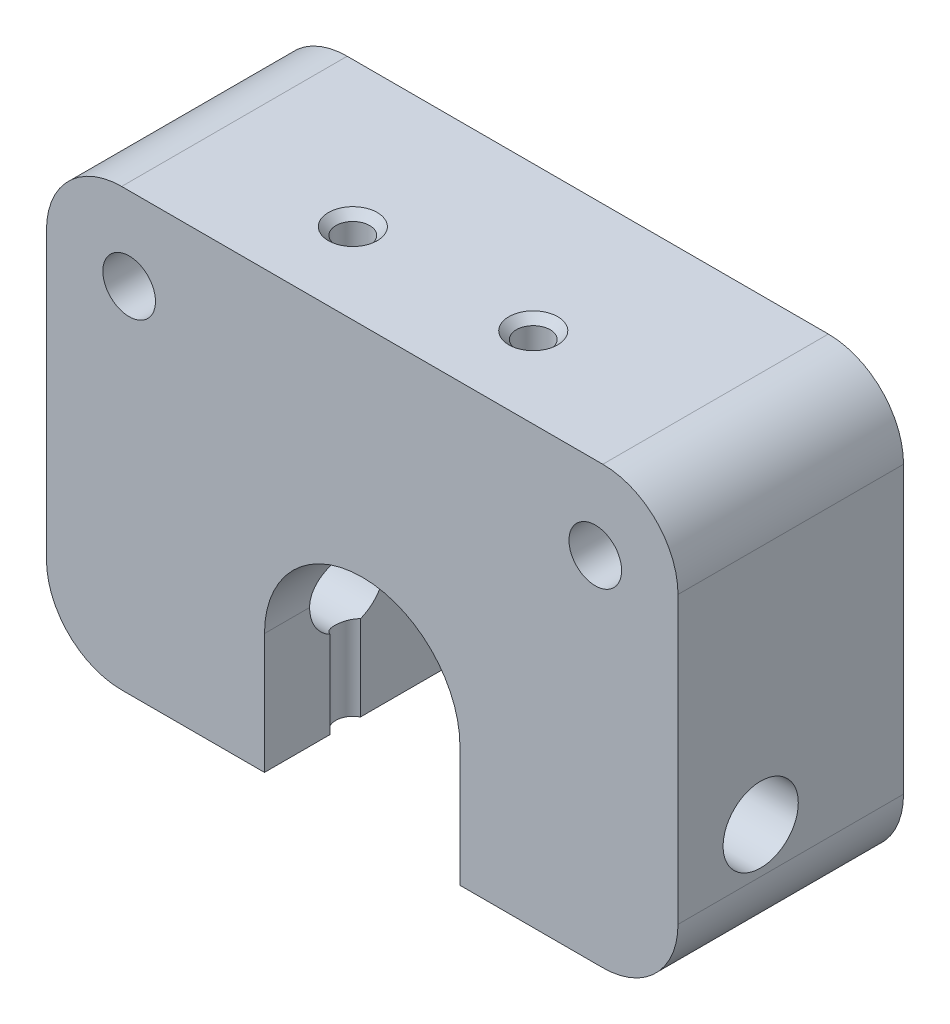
ISO-10303-21;
HEADER;
FILE_DESCRIPTION(('STEP AP214'),'2;1');
FILE_NAME('part.step','',(''),(''),'','','');
FILE_SCHEMA(('AUTOMOTIVE_DESIGN { 1 0 10303 214 1 1 1 1 }'));
ENDSEC;
DATA;
#1=APPLICATION_CONTEXT('core data for automotive mechanical design processes');
#2=APPLICATION_PROTOCOL_DEFINITION('international standard','automotive_design',2000,#1);
#3=PRODUCT_CONTEXT('',#1,'mechanical');
#4=PRODUCT('Part','Part','',(#3));
#5=PRODUCT_RELATED_PRODUCT_CATEGORY('part','',(#4));
#6=PRODUCT_DEFINITION_FORMATION('','',#4);
#7=PRODUCT_DEFINITION_CONTEXT('part definition',#1,'design');
#8=PRODUCT_DEFINITION('design','',#6,#7);
#9=PRODUCT_DEFINITION_SHAPE('','',#8);
#10=(LENGTH_UNIT() NAMED_UNIT(*) SI_UNIT(.MILLI.,.METRE.));
#11=(NAMED_UNIT(*) PLANE_ANGLE_UNIT() SI_UNIT($,.RADIAN.));
#12=(NAMED_UNIT(*) SI_UNIT($,.STERADIAN.) SOLID_ANGLE_UNIT());
#13=UNCERTAINTY_MEASURE_WITH_UNIT(LENGTH_MEASURE(1.E-05),#10,'distance_accuracy_value','');
#14=(GEOMETRIC_REPRESENTATION_CONTEXT(3) GLOBAL_UNCERTAINTY_ASSIGNED_CONTEXT((#13)) GLOBAL_UNIT_ASSIGNED_CONTEXT((#10,
#11,#12)) REPRESENTATION_CONTEXT('',''));
#15=CARTESIAN_POINT('',(0.,0.,0.));
#16=DIRECTION('',(0.,0.,1.));
#17=DIRECTION('',(1.,0.,0.));
#18=AXIS2_PLACEMENT_3D('',#15,#16,#17);
#19=CARTESIAN_POINT('',(6.5,-14.5,0.));
#20=DIRECTION('',(1.,0.,0.));
#21=DIRECTION('',(0.,1.,0.));
#22=AXIS2_PLACEMENT_3D('',#19,#20,#21);
#23=PLANE('',#22);
#24=DIRECTION('',(0.,1.,0.));
#25=VECTOR('',#24,1.);
#26=CARTESIAN_POINT('',(6.5,-14.5,3.));
#27=LINE('',#26,#25);
#28=CARTESIAN_POINT('',(6.5,-14.5,3.));
#29=VERTEX_POINT('',#28);
#30=CARTESIAN_POINT('',(6.5,-6.49999999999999,3.));
#31=VERTEX_POINT('',#30);
#32=EDGE_CURVE('E49',#29,#31,#27,.T.);
#33=ORIENTED_EDGE('',*,*,#32,.F.);
#34=DIRECTION('',(0.,0.,1.));
#35=VECTOR('',#34,1.);
#36=CARTESIAN_POINT('',(6.5,-14.5,0.));
#37=LINE('',#36,#35);
#38=CARTESIAN_POINT('',(6.5,-14.5,8.61721778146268));
#39=VERTEX_POINT('',#38);
#40=EDGE_CURVE('E357',#29,#39,#37,.T.);
#41=ORIENTED_EDGE('',*,*,#40,.T.);
#42=DIRECTION('',(0.,1.,0.));
#43=VECTOR('',#42,1.);
#44=CARTESIAN_POINT('',(6.5,-14.5,8.61721778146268));
#45=LINE('',#44,#43);
#46=CARTESIAN_POINT('',(6.5,-8.83895180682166,8.61721778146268));
#47=VERTEX_POINT('',#46);
#48=EDGE_CURVE('E325',#39,#47,#45,.T.);
#49=ORIENTED_EDGE('',*,*,#48,.T.);
#50=CARTESIAN_POINT('',(6.5,-6.5,9.5));
#51=DIRECTION('',(1.,0.,0.));
#52=DIRECTION('',(0.,1.,0.));
#53=AXIS2_PLACEMENT_3D('',#50,#51,#52);
#54=CIRCLE('',#53,2.5);
#55=CARTESIAN_POINT('',(6.5,-6.49999999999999,7.));
#56=VERTEX_POINT('',#55);
#57=EDGE_CURVE('E252',#47,#56,#54,.T.);
#58=ORIENTED_EDGE('',*,*,#57,.T.);
#59=DIRECTION('',(0.,0.,1.));
#60=VECTOR('',#59,1.);
#61=CARTESIAN_POINT('',(6.5,-6.49999999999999,0.));
#62=LINE('',#61,#60);
#63=EDGE_CURVE('E362',#31,#56,#62,.T.);
#64=ORIENTED_EDGE('',*,*,#63,.F.);
#65=EDGE_LOOP('',(#33,#41,#49,#58,#64));
#66=FACE_BOUND('',#65,.T.);
#67=ADVANCED_FACE('F35',(#66),#23,.F.);
#68=CARTESIAN_POINT('',(-6.5,-6.49999999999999,0.));
#69=DIRECTION('',(-1.,0.,0.));
#70=DIRECTION('',(0.,-1.,0.));
#71=AXIS2_PLACEMENT_3D('',#68,#69,#70);
#72=PLANE('',#71);
#73=DIRECTION('',(0.,-1.,0.));
#74=VECTOR('',#73,1.);
#75=CARTESIAN_POINT('',(-6.5,-6.49999999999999,3.));
#76=LINE('',#75,#74);
#77=CARTESIAN_POINT('',(-6.5,-6.49999999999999,3.));
#78=VERTEX_POINT('',#77);
#79=CARTESIAN_POINT('',(-6.5,-14.5,3.));
#80=VERTEX_POINT('',#79);
#81=EDGE_CURVE('E231',#78,#80,#76,.T.);
#82=ORIENTED_EDGE('',*,*,#81,.F.);
#83=DIRECTION('',(0.,0.,1.));
#84=VECTOR('',#83,1.);
#85=CARTESIAN_POINT('',(-6.5,-6.49999999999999,0.));
#86=LINE('',#85,#84);
#87=CARTESIAN_POINT('',(-6.5,-6.49999999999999,7.));
#88=VERTEX_POINT('',#87);
#89=EDGE_CURVE('E488',#78,#88,#86,.T.);
#90=ORIENTED_EDGE('',*,*,#89,.T.);
#91=CARTESIAN_POINT('',(-6.5,-6.5,9.5));
#92=DIRECTION('',(-1.,0.,0.));
#93=DIRECTION('',(0.,-1.,0.));
#94=AXIS2_PLACEMENT_3D('',#91,#92,#93);
#95=CIRCLE('',#94,2.5);
#96=CARTESIAN_POINT('',(-6.5,-8.83895180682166,8.61721778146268));
#97=VERTEX_POINT('',#96);
#98=EDGE_CURVE('E292',#88,#97,#95,.T.);
#99=ORIENTED_EDGE('',*,*,#98,.T.);
#100=DIRECTION('',(0.,1.,0.));
#101=VECTOR('',#100,1.);
#102=CARTESIAN_POINT('',(-6.5,-14.5,8.61721778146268));
#103=LINE('',#102,#101);
#104=CARTESIAN_POINT('',(-6.5,-14.5,8.61721778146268));
#105=VERTEX_POINT('',#104);
#106=EDGE_CURVE('E484',#97,#105,#103,.F.);
#107=ORIENTED_EDGE('',*,*,#106,.T.);
#108=DIRECTION('',(0.,0.,1.));
#109=VECTOR('',#108,1.);
#110=CARTESIAN_POINT('',(-6.5,-14.5,0.));
#111=LINE('',#110,#109);
#112=EDGE_CURVE('E374',#80,#105,#111,.T.);
#113=ORIENTED_EDGE('',*,*,#112,.F.);
#114=EDGE_LOOP('',(#82,#90,#99,#107,#113));
#115=FACE_BOUND('',#114,.T.);
#116=ADVANCED_FACE('F310',(#115),#72,.F.);
#117=CARTESIAN_POINT('',(0.,-6.49999999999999,0.));
#118=DIRECTION('',(0.,0.,1.));
#119=DIRECTION('',(1.,0.,0.));
#120=AXIS2_PLACEMENT_3D('',#117,#118,#119);
#121=CYLINDRICAL_SURFACE('',#120,6.5);
#122=CARTESIAN_POINT('',(0.,-6.49999999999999,3.));
#123=DIRECTION('',(0.,0.,-1.));
#124=DIRECTION('',(0.,1.,0.));
#125=AXIS2_PLACEMENT_3D('',#122,#123,#124);
#126=CIRCLE('',#125,6.5);
#127=EDGE_CURVE('E11',#31,#78,#126,.F.);
#128=ORIENTED_EDGE('',*,*,#127,.F.);
#129=ORIENTED_EDGE('',*,*,#63,.T.);
#130=CARTESIAN_POINT('',(6.5,-6.49999999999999,7.));
#131=CARTESIAN_POINT('',(6.5000097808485,-6.43231958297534,6.99999070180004));
#132=CARTESIAN_POINT('',(6.49894316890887,-6.36464525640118,7.0027481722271));
#133=CARTESIAN_POINT('',(6.49473011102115,-6.22982457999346,7.01372443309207));
#134=CARTESIAN_POINT('',(6.49158424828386,-6.16267808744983,7.02194169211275));
#135=CARTESIAN_POINT('',(6.48329909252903,-6.02960764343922,7.04372981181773));
#136=CARTESIAN_POINT('',(6.47816633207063,-5.96368041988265,7.0572831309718));
#137=CARTESIAN_POINT('',(6.4660508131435,-5.8333056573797,7.08959854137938));
#138=CARTESIAN_POINT('',(6.45906798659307,-5.76885817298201,7.10836082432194));
#139=CARTESIAN_POINT('',(6.43560969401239,-5.57847808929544,7.17219747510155));
#140=CARTESIAN_POINT('',(6.41661086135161,-5.45530322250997,7.22485560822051));
#141=CARTESIAN_POINT('',(6.37376828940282,-5.21957285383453,7.34865607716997));
#142=CARTESIAN_POINT('',(6.34992131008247,-5.10702452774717,7.41981078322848));
#143=CARTESIAN_POINT('',(6.29865835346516,-4.89073450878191,7.58186756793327));
#144=CARTESIAN_POINT('',(6.27113819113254,-4.78752068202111,7.67344215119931));
#145=CARTESIAN_POINT('',(6.21612828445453,-4.59748609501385,7.87231060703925));
#146=CARTESIAN_POINT('',(6.18863855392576,-4.51067101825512,7.97960990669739));
#147=CARTESIAN_POINT('',(6.13556700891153,-4.35242562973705,8.21217697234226));
#148=CARTESIAN_POINT('',(6.11010759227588,-4.28176100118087,8.33799654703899));
#149=CARTESIAN_POINT('',(6.06561850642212,-4.16283627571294,8.60086152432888));
#150=CARTESIAN_POINT('',(6.04658589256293,-4.11456591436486,8.73790174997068));
#151=CARTESIAN_POINT('',(6.01822744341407,-4.04391773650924,9.01319542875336));
#152=CARTESIAN_POINT('',(6.00852187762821,-4.02052244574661,9.15114728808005));
#153=CARTESIAN_POINT('',(5.99880895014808,-3.99710799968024,9.4293367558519));
#154=CARTESIAN_POINT('',(5.99879749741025,-3.9970789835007,9.56957337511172));
#155=CARTESIAN_POINT('',(6.00814840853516,-4.01962351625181,9.83886520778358));
#156=CARTESIAN_POINT('',(6.01691575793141,-4.04076234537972,9.96806509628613));
#157=CARTESIAN_POINT('',(6.04184363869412,-4.10266253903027,10.2209168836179));
#158=CARTESIAN_POINT('',(6.05800523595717,-4.14342673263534,10.3445679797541));
#159=CARTESIAN_POINT('',(6.09624364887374,-4.2441731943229,10.5856579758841));
#160=CARTESIAN_POINT('',(6.11842976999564,-4.30451506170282,10.7029285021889));
#161=CARTESIAN_POINT('',(6.16618353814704,-4.44245356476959,10.9260873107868));
#162=CARTESIAN_POINT('',(6.19175241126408,-4.52005646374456,11.0319714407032));
#163=CARTESIAN_POINT('',(6.24560168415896,-4.69678864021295,11.2372523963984));
#164=CARTESIAN_POINT('',(6.27394578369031,-4.79705424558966,11.3356565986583));
#165=CARTESIAN_POINT('',(6.32860352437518,-5.01300046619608,11.514570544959));
#166=CARTESIAN_POINT('',(6.35491656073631,-5.12868564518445,11.595074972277));
#167=CARTESIAN_POINT('',(6.40312687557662,-5.37485043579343,11.7370923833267));
#168=CARTESIAN_POINT('',(6.42493885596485,-5.5055534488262,11.7982485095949));
#169=CARTESIAN_POINT('',(6.46103231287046,-5.77638156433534,11.8973082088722));
#170=CARTESIAN_POINT('',(6.47532520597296,-5.91649201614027,11.9352470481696));
#171=CARTESIAN_POINT('',(6.4899677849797,-6.13167041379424,11.973825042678));
#172=CARTESIAN_POINT('',(6.49371792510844,-6.20497600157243,11.9836319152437));
#173=CARTESIAN_POINT('',(6.49873694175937,-6.35217356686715,11.9967178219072));
#174=CARTESIAN_POINT('',(6.50000841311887,-6.42606484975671,12.0000036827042));
#175=CARTESIAN_POINT('',(6.5,-6.49999999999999,12.));
#176=B_SPLINE_CURVE_WITH_KNOTS('',3,(#130,#131,#132,#133,#134,#135,#136,#137,#138,#139,#140,
#141,#142,#143,#144,#145,#146,#147,#148,#149,#150,#151,#152,#153,#154,#155,#156,#157,#158,#159,
#160,#161,#162,#163,#164,#165,#166,#167,#168,#169,#170,#171,#172,#173,#174,#175),.UNSPECIFIED.,
.F.,.F.,(4,2,2,2,2,2,2,2,2,2,2,2,2,2,2,2,2,2,2,2,2,2,4),(0.,0.202966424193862,0.405875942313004,
0.608123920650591,0.810379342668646,1.21427440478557,1.61844028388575,2.03867105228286,
2.45904719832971,2.8964523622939,3.33365684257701,3.75219523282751,4.17055699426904,
4.56236067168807,4.95422084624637,5.3537300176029,5.75338439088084,6.18138195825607,
6.60950648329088,7.04512029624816,7.48007077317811,7.70193966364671,7.92357616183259),.UNSPECIFIED.);
#177=CARTESIAN_POINT('',(6.08226807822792,-4.20739994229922,8.50301204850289));
#178=VERTEX_POINT('',#177);
#179=EDGE_CURVE('E251',#56,#178,#176,.T.);
#180=ORIENTED_EDGE('',*,*,#179,.T.);
#181=CARTESIAN_POINT('',(6.5,-6.49999999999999,8.61721778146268));
#182=CARTESIAN_POINT('',(6.49999870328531,-6.32958655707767,8.61720701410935));
#183=CARTESIAN_POINT('',(6.49328957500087,-6.15914608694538,8.61380174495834));
#184=CARTESIAN_POINT('',(6.46652245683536,-5.81944697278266,8.60118944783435));
#185=CARTESIAN_POINT('',(6.44645494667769,-5.65018925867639,8.59197828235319));
#186=CARTESIAN_POINT('',(6.39308799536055,-5.31360416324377,8.57051899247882));
#187=CARTESIAN_POINT('',(6.35975910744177,-5.14628193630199,8.55826413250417));
#188=CARTESIAN_POINT('',(6.28005293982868,-4.81477886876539,8.53462192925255));
#189=CARTESIAN_POINT('',(6.23368299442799,-4.65059631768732,8.52323410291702));
#190=CARTESIAN_POINT('',(6.15152370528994,-4.3981528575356,8.50985636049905));
#191=CARTESIAN_POINT('',(6.12017163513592,-4.30853504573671,8.50593858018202));
#192=CARTESIAN_POINT('',(6.05354627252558,-4.13069831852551,8.50077764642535));
#193=CARTESIAN_POINT('',(6.01827379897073,-4.04247911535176,8.499533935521));
#194=CARTESIAN_POINT('',(5.94396229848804,-3.86783448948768,8.50078300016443));
#195=CARTESIAN_POINT('',(5.90493015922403,-3.78140612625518,8.50326906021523));
#196=CARTESIAN_POINT('',(5.82325914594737,-3.61060175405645,8.5132092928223));
#197=CARTESIAN_POINT('',(5.78062165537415,-3.52622497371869,8.52066156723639));
#198=CARTESIAN_POINT('',(5.67904383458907,-3.33563221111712,8.54513986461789));
#199=CARTESIAN_POINT('',(5.61898220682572,-3.23024524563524,8.56432824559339));
#200=CARTESIAN_POINT('',(5.52593880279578,-3.07690265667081,8.60420633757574));
#201=CARTESIAN_POINT('',(5.49443962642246,-3.02658845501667,8.61934382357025));
#202=CARTESIAN_POINT('',(5.43079870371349,-2.92790464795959,8.65394493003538));
#203=CARTESIAN_POINT('',(5.39865726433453,-2.87953414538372,8.6734065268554));
#204=CARTESIAN_POINT('',(5.32502570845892,-2.77180055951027,8.72358518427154));
#205=CARTESIAN_POINT('',(5.28347293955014,-2.71321690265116,8.75592910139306));
#206=CARTESIAN_POINT('',(5.20165948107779,-2.60160267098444,8.83043745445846));
#207=CARTESIAN_POINT('',(5.16139703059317,-2.54856428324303,8.87258779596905));
#208=CARTESIAN_POINT('',(5.09457219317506,-2.46298512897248,8.95575544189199));
#209=CARTESIAN_POINT('',(5.0671553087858,-2.42868651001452,8.99425911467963));
#210=CARTESIAN_POINT('',(5.0158808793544,-2.36568242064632,9.07771297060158));
#211=CARTESIAN_POINT('',(4.99201846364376,-2.33696927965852,9.12265416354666));
#212=CARTESIAN_POINT('',(4.95381331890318,-2.29162290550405,9.20919559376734));
#213=CARTESIAN_POINT('',(4.93852127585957,-2.27372417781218,9.2497083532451));
#214=CARTESIAN_POINT('',(4.9123693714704,-2.24335454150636,9.33408672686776));
#215=CARTESIAN_POINT('',(4.90150708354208,-2.23088066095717,9.37795048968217));
#216=CARTESIAN_POINT('',(4.88502697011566,-2.21203155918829,9.46823203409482));
#217=CARTESIAN_POINT('',(4.87944098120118,-2.20569335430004,9.51466355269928));
#218=CARTESIAN_POINT('',(4.87414886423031,-2.19968710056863,9.60828756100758));
#219=CARTESIAN_POINT('',(4.87444064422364,-2.20001667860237,9.65547977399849));
#220=CARTESIAN_POINT('',(4.88054542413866,-2.2069484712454,9.74429638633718));
#221=CARTESIAN_POINT('',(4.88581037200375,-2.21292806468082,9.78601041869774));
#222=CARTESIAN_POINT('',(4.90068186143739,-2.22993632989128,9.86757769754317));
#223=CARTESIAN_POINT('',(4.91028869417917,-2.24096534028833,9.90743081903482));
#224=CARTESIAN_POINT('',(4.93362468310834,-2.26801766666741,9.98583636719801));
#225=CARTESIAN_POINT('',(4.94748984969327,-2.28420655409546,10.0242902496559));
#226=CARTESIAN_POINT('',(4.97838514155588,-2.32073503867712,10.0977793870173));
#227=CARTESIAN_POINT('',(4.99541683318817,-2.3410766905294,10.1328129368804));
#228=CARTESIAN_POINT('',(5.04156902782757,-2.3970146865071,10.2169516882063));
#229=CARTESIAN_POINT('',(5.07229698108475,-2.43496572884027,10.2636145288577));
#230=CARTESIAN_POINT('',(5.13694712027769,-2.51697021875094,10.3486238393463));
#231=CARTESIAN_POINT('',(5.17087701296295,-2.56103851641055,10.3869494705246));
#232=CARTESIAN_POINT('',(5.25837342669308,-2.67805830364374,10.4742350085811));
#233=CARTESIAN_POINT('',(5.31288355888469,-2.75401224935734,10.5181890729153));
#234=CARTESIAN_POINT('',(5.42133342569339,-2.91273567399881,10.5919973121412));
#235=CARTESIAN_POINT('',(5.47527188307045,-2.99551780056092,10.6218245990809));
#236=CARTESIAN_POINT('',(5.57446940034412,-3.15588031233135,10.6676743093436));
#237=CARTESIAN_POINT('',(5.62001138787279,-3.23295720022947,10.6848932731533));
#238=CARTESIAN_POINT('',(5.7083564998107,-3.38988975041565,10.7125261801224));
#239=CARTESIAN_POINT('',(5.75115742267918,-3.46974756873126,10.7229347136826));
#240=CARTESIAN_POINT('',(5.83365961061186,-3.63177683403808,10.7384275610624));
#241=CARTESIAN_POINT('',(5.87335290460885,-3.71395353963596,10.743498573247));
#242=CARTESIAN_POINT('',(5.94929988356,-3.88004229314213,10.7495011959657));
#243=CARTESIAN_POINT('',(5.98555229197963,-3.96395497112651,10.750431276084));
#244=CARTESIAN_POINT('',(6.08494036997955,-4.2080316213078,10.7486739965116));
#245=CARTESIAN_POINT('',(6.14351545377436,-4.37003595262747,10.7420626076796));
#246=CARTESIAN_POINT('',(6.24758602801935,-4.69796657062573,10.723685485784));
#247=CARTESIAN_POINT('',(6.29306983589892,-4.86389621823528,10.7119151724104));
#248=CARTESIAN_POINT('',(6.37070024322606,-5.19860016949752,10.6879474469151));
#249=CARTESIAN_POINT('',(6.40286386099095,-5.36737055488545,10.6757506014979));
#250=CARTESIAN_POINT('',(6.45373920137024,-5.70707557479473,10.6548097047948));
#251=CARTESIAN_POINT('',(6.47245730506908,-5.8780091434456,10.6460640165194));
#252=CARTESIAN_POINT('',(6.49675188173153,-6.22775538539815,10.6344863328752));
#253=CARTESIAN_POINT('',(6.50178653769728,-6.40661504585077,10.6318986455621));
#254=CARTESIAN_POINT('',(6.49709214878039,-6.76412714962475,10.6342217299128));
#255=CARTESIAN_POINT('',(6.4873596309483,-6.94277953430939,10.6391342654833));
#256=CARTESIAN_POINT('',(6.45321702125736,-7.29878244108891,10.6548362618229));
#257=CARTESIAN_POINT('',(6.42877421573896,-7.47612916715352,10.6656388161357));
#258=CARTESIAN_POINT('',(6.36540063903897,-7.82801704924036,10.6895420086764));
#259=CARTESIAN_POINT('',(6.32647296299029,-8.00255879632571,10.7026421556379));
#260=CARTESIAN_POINT('',(6.25009656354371,-8.28888973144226,10.7222920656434));
#261=CARTESIAN_POINT('',(6.21669574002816,-8.40172392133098,10.7295497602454));
#262=CARTESIAN_POINT('',(6.14377403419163,-8.62553159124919,10.7413873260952));
#263=CARTESIAN_POINT('',(6.10425460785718,-8.73650550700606,10.7459678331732));
#264=CARTESIAN_POINT('',(6.01935633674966,-8.95583483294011,10.7506341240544));
#265=CARTESIAN_POINT('',(5.97399977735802,-9.06419843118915,10.7507365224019));
#266=CARTESIAN_POINT('',(5.87756906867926,-9.27811529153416,10.7443621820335));
#267=CARTESIAN_POINT('',(5.82649897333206,-9.38367048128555,10.7378900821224));
#268=CARTESIAN_POINT('',(5.72145981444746,-9.5866455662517,10.7162342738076));
#269=CARTESIAN_POINT('',(5.66771332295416,-9.68421963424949,10.7014415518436));
#270=CARTESIAN_POINT('',(5.55628705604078,-9.87488209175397,10.6605065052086));
#271=CARTESIAN_POINT('',(5.4986051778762,-9.96796803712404,10.6343580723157));
#272=CARTESIAN_POINT('',(5.39148862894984,-10.1317640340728,10.5728713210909));
#273=CARTESIAN_POINT('',(5.34236193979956,-10.2035520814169,10.5399184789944));
#274=CARTESIAN_POINT('',(5.24486074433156,-10.340367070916,10.4612412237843));
#275=CARTESIAN_POINT('',(5.19648463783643,-10.405410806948,10.4155496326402));
#276=CARTESIAN_POINT('',(5.12096624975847,-10.5035042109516,10.3285051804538));
#277=CARTESIAN_POINT('',(5.09252805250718,-10.5395557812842,10.2916755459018));
#278=CARTESIAN_POINT('',(5.03877075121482,-10.6064116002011,10.2115027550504));
#279=CARTESIAN_POINT('',(5.01344790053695,-10.6372221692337,10.1681675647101));
#280=CARTESIAN_POINT('',(4.97171911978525,-10.6872283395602,10.0833478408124));
#281=CARTESIAN_POINT('',(4.95452825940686,-10.7075148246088,10.0428991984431));
#282=CARTESIAN_POINT('',(4.92452091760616,-10.7425968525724,9.9581451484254));
#283=CARTESIAN_POINT('',(4.9117022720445,-10.7573951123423,9.91384166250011));
#284=CARTESIAN_POINT('',(4.89138863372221,-10.7807199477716,9.82204979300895));
#285=CARTESIAN_POINT('',(4.88393295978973,-10.7892002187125,9.77454062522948));
#286=CARTESIAN_POINT('',(4.87522301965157,-10.7990984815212,9.67823531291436));
#287=CARTESIAN_POINT('',(4.87396508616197,-10.8005206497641,9.62943994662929));
#288=CARTESIAN_POINT('',(4.87753051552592,-10.7964750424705,9.53833365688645));
#289=CARTESIAN_POINT('',(4.88163496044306,-10.7918218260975,9.4959539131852));
#290=CARTESIAN_POINT('',(4.8943893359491,-10.7772708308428,9.41282464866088));
#291=CARTESIAN_POINT('',(4.90303931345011,-10.7673729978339,9.37207514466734));
#292=CARTESIAN_POINT('',(4.92443870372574,-10.7426608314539,9.29256287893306));
#293=CARTESIAN_POINT('',(4.93724602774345,-10.7277769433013,9.25383772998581));
#294=CARTESIAN_POINT('',(4.96614647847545,-10.6937916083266,9.1796226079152));
#295=CARTESIAN_POINT('',(4.98224107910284,-10.6746882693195,9.1441340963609));
#296=CARTESIAN_POINT('',(5.02557638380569,-10.622525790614,9.05989100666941));
#297=CARTESIAN_POINT('',(5.05438103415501,-10.5872494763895,9.0133098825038));
#298=CARTESIAN_POINT('',(5.11537344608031,-10.5106572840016,8.92798793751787));
#299=CARTESIAN_POINT('',(5.14756910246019,-10.4693272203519,8.88926605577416));
#300=CARTESIAN_POINT('',(5.23027868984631,-10.3601682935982,8.80133697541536));
#301=CARTESIAN_POINT('',(5.28184291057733,-10.289486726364,8.75668904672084));
#302=CARTESIAN_POINT('',(5.38501205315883,-10.1414086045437,8.68079216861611));
#303=CARTESIAN_POINT('',(5.43661687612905,-10.0639999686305,8.64956795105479));
#304=CARTESIAN_POINT('',(5.53131695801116,-9.91486609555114,8.60108321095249));
#305=CARTESIAN_POINT('',(5.57465172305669,-9.84369428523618,8.58254162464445));
#306=CARTESIAN_POINT('',(5.65911784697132,-9.69866165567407,8.55194639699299));
#307=CARTESIAN_POINT('',(5.70024747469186,-9.62479879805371,8.53989778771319));
#308=CARTESIAN_POINT('',(5.77992695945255,-9.47484012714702,8.52097421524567));
#309=CARTESIAN_POINT('',(5.81847028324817,-9.39873930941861,8.51411193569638));
#310=CARTESIAN_POINT('',(5.89262823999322,-9.24485629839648,8.50451271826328));
#311=CARTESIAN_POINT('',(5.92824176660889,-9.16707348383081,8.50177733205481));
#312=CARTESIAN_POINT('',(6.02764620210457,-8.93810857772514,8.49843409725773));
#313=CARTESIAN_POINT('',(6.08730954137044,-8.78506188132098,8.50208105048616));
#314=CARTESIAN_POINT('',(6.19483778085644,-8.47508568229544,8.51567951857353));
#315=CARTESIAN_POINT('',(6.24269049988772,-8.31815235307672,8.52563750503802));
#316=CARTESIAN_POINT('',(6.32633291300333,-8.00143353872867,8.54750412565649));
#317=CARTESIAN_POINT('',(6.3621360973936,-7.84165145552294,8.55941055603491));
#318=CARTESIAN_POINT('',(6.42157970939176,-7.51983328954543,8.58149259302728));
#319=CARTESIAN_POINT('',(6.44522980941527,-7.35779910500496,8.59166957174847));
#320=CARTESIAN_POINT('',(6.47514026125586,-7.07966897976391,8.6051732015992));
#321=CARTESIAN_POINT('',(6.48446019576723,-6.96395143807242,8.60963198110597));
#322=CARTESIAN_POINT('',(6.4968890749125,-6.73215998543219,8.61565727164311));
#323=CARTESIAN_POINT('',(6.50000088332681,-6.61608626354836,8.61722511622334));
#324=CARTESIAN_POINT('',(6.5,-6.49999999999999,8.61721778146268));
#325=B_SPLINE_CURVE_WITH_KNOTS('',3,(#181,#182,#183,#184,#185,#186,#187,#188,#189,#190,#191,
#192,#193,#194,#195,#196,#197,#198,#199,#200,#201,#202,#203,#204,#205,#206,#207,#208,#209,#210,
#211,#212,#213,#214,#215,#216,#217,#218,#219,#220,#221,#222,#223,#224,#225,#226,#227,#228,#229,
#230,#231,#232,#233,#234,#235,#236,#237,#238,#239,#240,#241,#242,#243,#244,#245,#246,#247,#248,
#249,#250,#251,#252,#253,#254,#255,#256,#257,#258,#259,#260,#261,#262,#263,#264,#265,#266,#267,
#268,#269,#270,#271,#272,#273,#274,#275,#276,#277,#278,#279,#280,#281,#282,#283,#284,#285,#286,
#287,#288,#289,#290,#291,#292,#293,#294,#295,#296,#297,#298,#299,#300,#301,#302,#303,#304,#305,
#306,#307,#308,#309,#310,#311,#312,#313,#314,#315,#316,#317,#318,#319,#320,#321,#322,#323,#324),
.UNSPECIFIED.,.T.,.F.,(4,2,2,2,2,2,2,2,2,2,2,2,2,2,2,2,2,2,2,2,2,2,2,2,2,2,2,2,2,2,2,2,2,2,2,2,
2,2,2,2,2,2,2,2,2,2,2,2,2,2,2,2,2,2,2,2,2,2,2,2,2,2,2,2,2,2,2,2,2,2,2,4),(0.,0.511130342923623,
1.02262534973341,1.53526252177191,2.04761196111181,2.3325808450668,2.61749031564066,
2.90188741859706,3.18617588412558,3.55359829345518,3.73723022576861,3.92077640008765,
4.15644911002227,4.39178516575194,4.56640155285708,4.74077641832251,4.88078095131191,
5.02070868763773,5.16147543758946,5.30219208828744,5.42901331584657,5.55584304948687,
5.68724076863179,5.81870365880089,6.0201792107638,6.22215270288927,6.53033491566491,
6.83910136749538,7.11220608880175,7.38552747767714,7.65952840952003,7.93363059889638,
8.45000764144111,8.96684407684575,9.48301813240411,9.9989470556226,10.5350262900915,
11.0712316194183,11.6086338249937,12.1459212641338,12.4994443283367,12.8528833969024,
13.2050110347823,13.5568903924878,13.8934711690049,14.2302332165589,14.5084950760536,
14.7860465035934,14.9621043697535,15.1379483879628,15.282592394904,15.4271647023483,
15.5727864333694,15.7183219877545,15.8462099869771,15.9740993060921,16.1038525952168,
16.2336641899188,16.4279963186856,16.6227913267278,16.9158168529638,17.2093799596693,
17.465105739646,17.7210294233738,17.9775769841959,18.2342209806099,18.7263401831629,
19.2189648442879,19.7110361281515,20.2027151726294,20.5510597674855,20.8992436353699),.UNSPECIFIED.);
#326=CARTESIAN_POINT('',(6.12735447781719,-4.33077730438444,10.7427682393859));
#327=VERTEX_POINT('',#326);
#328=EDGE_CURVE('E554',#178,#327,#325,.T.);
#329=ORIENTED_EDGE('',*,*,#328,.T.);
#330=CARTESIAN_POINT('',(6.5,-6.49999999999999,12.));
#331=VERTEX_POINT('',#330);
#332=EDGE_CURVE('E241',#327,#331,#176,.T.);
#333=ORIENTED_EDGE('',*,*,#332,.T.);
#334=CARTESIAN_POINT('',(6.5,-6.49999999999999,15.));
#335=VERTEX_POINT('',#334);
#336=EDGE_CURVE('E359',#331,#335,#62,.T.);
#337=ORIENTED_EDGE('',*,*,#336,.T.);
#338=CARTESIAN_POINT('',(0.,-6.49999999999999,15.));
#339=DIRECTION('',(0.,0.,1.));
#340=DIRECTION('',(1.,0.,0.));
#341=AXIS2_PLACEMENT_3D('',#338,#339,#340);
#342=CIRCLE('',#341,6.5);
#343=CARTESIAN_POINT('',(-6.5,-6.49999999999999,15.));
#344=VERTEX_POINT('',#343);
#345=EDGE_CURVE('E513',#335,#344,#342,.T.);
#346=ORIENTED_EDGE('',*,*,#345,.T.);
#347=CARTESIAN_POINT('',(-6.5,-6.49999999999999,12.));
#348=VERTEX_POINT('',#347);
#349=EDGE_CURVE('E491',#348,#344,#86,.T.);
#350=ORIENTED_EDGE('',*,*,#349,.F.);
#351=CARTESIAN_POINT('',(-6.5,-6.49999999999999,12.));
#352=CARTESIAN_POINT('',(-6.5000097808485,-6.43231958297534,12.0000092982));
#353=CARTESIAN_POINT('',(-6.49894316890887,-6.36464525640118,11.9972518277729));
#354=CARTESIAN_POINT('',(-6.49473011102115,-6.22982457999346,11.9862755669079));
#355=CARTESIAN_POINT('',(-6.49158424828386,-6.16267808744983,11.9780583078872));
#356=CARTESIAN_POINT('',(-6.48329909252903,-6.02960764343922,11.9562701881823));
#357=CARTESIAN_POINT('',(-6.47816633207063,-5.96368041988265,11.9427168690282));
#358=CARTESIAN_POINT('',(-6.4660508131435,-5.8333056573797,11.9104014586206));
#359=CARTESIAN_POINT('',(-6.45906798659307,-5.76885817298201,11.8916391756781));
#360=CARTESIAN_POINT('',(-6.43560969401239,-5.57847808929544,11.8278025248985));
#361=CARTESIAN_POINT('',(-6.41661086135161,-5.45530322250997,11.7751443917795));
#362=CARTESIAN_POINT('',(-6.37376828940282,-5.21957285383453,11.65134392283));
#363=CARTESIAN_POINT('',(-6.34992131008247,-5.10702452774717,11.5801892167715));
#364=CARTESIAN_POINT('',(-6.29865835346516,-4.89073450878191,11.4181324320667));
#365=CARTESIAN_POINT('',(-6.27113819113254,-4.78752068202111,11.3265578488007));
#366=CARTESIAN_POINT('',(-6.21612828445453,-4.59748609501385,11.1276893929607));
#367=CARTESIAN_POINT('',(-6.18863855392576,-4.51067101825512,11.0203900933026));
#368=CARTESIAN_POINT('',(-6.13556700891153,-4.35242562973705,10.7878230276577));
#369=CARTESIAN_POINT('',(-6.11010759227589,-4.28176100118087,10.662003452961));
#370=CARTESIAN_POINT('',(-6.06561850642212,-4.16283627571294,10.3991384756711));
#371=CARTESIAN_POINT('',(-6.04658589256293,-4.11456591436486,10.2620982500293));
#372=CARTESIAN_POINT('',(-6.01822744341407,-4.04391773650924,9.98680457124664));
#373=CARTESIAN_POINT('',(-6.00852187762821,-4.02052244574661,9.84885271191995));
#374=CARTESIAN_POINT('',(-5.99880895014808,-3.99710799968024,9.5706632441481));
#375=CARTESIAN_POINT('',(-5.99879749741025,-3.9970789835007,9.43042662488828));
#376=CARTESIAN_POINT('',(-6.00814840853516,-4.01962351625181,9.16113479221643));
#377=CARTESIAN_POINT('',(-6.01691575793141,-4.04076234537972,9.03193490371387));
#378=CARTESIAN_POINT('',(-6.04184363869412,-4.10266253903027,8.77908311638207));
#379=CARTESIAN_POINT('',(-6.05800523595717,-4.14342673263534,8.65543202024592));
#380=CARTESIAN_POINT('',(-6.09624364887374,-4.2441731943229,8.41434202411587));
#381=CARTESIAN_POINT('',(-6.11842976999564,-4.30451506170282,8.29707149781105));
#382=CARTESIAN_POINT('',(-6.16618353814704,-4.44245356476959,8.07391268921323));
#383=CARTESIAN_POINT('',(-6.19175241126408,-4.52005646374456,7.96802855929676));
#384=CARTESIAN_POINT('',(-6.24560168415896,-4.69678864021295,7.76274760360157));
#385=CARTESIAN_POINT('',(-6.27394578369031,-4.79705424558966,7.6643434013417));
#386=CARTESIAN_POINT('',(-6.32860352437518,-5.01300046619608,7.48542945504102));
#387=CARTESIAN_POINT('',(-6.35491656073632,-5.12868564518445,7.40492502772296));
#388=CARTESIAN_POINT('',(-6.40312687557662,-5.37485043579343,7.26290761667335));
#389=CARTESIAN_POINT('',(-6.42493885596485,-5.5055534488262,7.20175149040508));
#390=CARTESIAN_POINT('',(-6.46103231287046,-5.77638156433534,7.1026917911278));
#391=CARTESIAN_POINT('',(-6.47532520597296,-5.91649201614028,7.06475295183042));
#392=CARTESIAN_POINT('',(-6.4899677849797,-6.13167041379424,7.02617495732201));
#393=CARTESIAN_POINT('',(-6.49371792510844,-6.20497600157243,7.01636808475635));
#394=CARTESIAN_POINT('',(-6.49873694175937,-6.35217356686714,7.00328217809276));
#395=CARTESIAN_POINT('',(-6.50000841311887,-6.42606484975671,6.99999631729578));
#396=CARTESIAN_POINT('',(-6.5,-6.49999999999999,7.));
#397=B_SPLINE_CURVE_WITH_KNOTS('',3,(#351,#352,#353,#354,#355,#356,#357,#358,#359,#360,#361,
#362,#363,#364,#365,#366,#367,#368,#369,#370,#371,#372,#373,#374,#375,#376,#377,#378,#379,#380,
#381,#382,#383,#384,#385,#386,#387,#388,#389,#390,#391,#392,#393,#394,#395,#396),.UNSPECIFIED.,
.F.,.F.,(4,2,2,2,2,2,2,2,2,2,2,2,2,2,2,2,2,2,2,2,2,2,4),(0.,0.202966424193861,0.405875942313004,
0.608123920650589,0.810379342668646,1.21427440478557,1.61844028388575,2.03867105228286,
2.45904719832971,2.8964523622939,3.33365684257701,3.75219523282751,4.17055699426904,
4.56236067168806,4.95422084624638,5.3537300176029,5.75338439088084,6.18138195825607,
6.60950648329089,7.04512029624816,7.48007077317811,7.70193966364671,7.92357616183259),.UNSPECIFIED.);
#398=CARTESIAN_POINT('',(-6.12735447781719,-4.33077730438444,10.7427682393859));
#399=VERTEX_POINT('',#398);
#400=EDGE_CURVE('E291',#348,#399,#397,.T.);
#401=ORIENTED_EDGE('',*,*,#400,.T.);
#402=CARTESIAN_POINT('',(-6.5,-6.49999999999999,10.6327822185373));
#403=CARTESIAN_POINT('',(-6.50000157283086,-6.41490819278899,10.6327602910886));
#404=CARTESIAN_POINT('',(-6.49832914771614,-6.32982004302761,10.633610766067));
#405=CARTESIAN_POINT('',(-6.4916489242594,-6.15981764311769,10.6368949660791));
#406=CARTESIAN_POINT('',(-6.48664162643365,-6.074903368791,10.6393284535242));
#407=CARTESIAN_POINT('',(-6.47330624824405,-5.90541477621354,10.6456162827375));
#408=CARTESIAN_POINT('',(-6.46497915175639,-5.82084036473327,10.6494702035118));
#409=CARTESIAN_POINT('',(-6.44502553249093,-5.65214324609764,10.6582935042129));
#410=CARTESIAN_POINT('',(-6.43339891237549,-5.5680205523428,10.6632629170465));
#411=CARTESIAN_POINT('',(-6.39342399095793,-5.31537613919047,10.6793632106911));
#412=CARTESIAN_POINT('',(-6.36006872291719,-5.14769765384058,10.6916355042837));
#413=CARTESIAN_POINT('',(-6.28025284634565,-4.81548318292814,10.7153272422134));
#414=CARTESIAN_POINT('',(-6.23379707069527,-4.65094606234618,10.7267469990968));
#415=CARTESIAN_POINT('',(-6.1515182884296,-4.39813663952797,10.7401447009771));
#416=CARTESIAN_POINT('',(-6.12015992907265,-4.30850170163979,10.7440629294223));
#417=CARTESIAN_POINT('',(-6.05351446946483,-4.13061552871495,10.7492242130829));
#418=CARTESIAN_POINT('',(-6.01822746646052,-4.04236425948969,10.7504673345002));
#419=CARTESIAN_POINT('',(-5.94390865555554,-3.86771437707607,10.7492140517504));
#420=CARTESIAN_POINT('',(-5.90488626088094,-3.78131174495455,10.7467268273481));
#421=CARTESIAN_POINT('',(-5.82323612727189,-3.61055619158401,10.7367866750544));
#422=CARTESIAN_POINT('',(-5.78060970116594,-3.52620253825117,10.7293355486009));
#423=CARTESIAN_POINT('',(-5.67904032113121,-3.33562562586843,10.7048592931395));
#424=CARTESIAN_POINT('',(-5.61897481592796,-3.23023228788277,10.6856694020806));
#425=CARTESIAN_POINT('',(-5.52592918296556,-3.07688719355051,10.6457891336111));
#426=CARTESIAN_POINT('',(-5.49443190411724,-3.02657630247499,10.630652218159));
#427=CARTESIAN_POINT('',(-5.43079481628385,-2.92789879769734,10.5960527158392));
#428=CARTESIAN_POINT('',(-5.39865531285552,-2.87953129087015,10.5765921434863));
#429=CARTESIAN_POINT('',(-5.32502763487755,-2.77180337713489,10.52641612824));
#430=CARTESIAN_POINT('',(-5.28347681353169,-2.7132223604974,10.4940739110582));
#431=CARTESIAN_POINT('',(-5.20166322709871,-2.60160760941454,10.4195664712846));
#432=CARTESIAN_POINT('',(-5.16139881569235,-2.54856657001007,10.3774144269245));
#433=CARTESIAN_POINT('',(-5.09457166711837,-2.46298445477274,10.2942439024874));
#434=CARTESIAN_POINT('',(-5.06715429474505,-2.42868524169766,10.2557394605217));
#435=CARTESIAN_POINT('',(-5.01587999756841,-2.36568135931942,10.1722853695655));
#436=CARTESIAN_POINT('',(-4.99201807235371,-2.33696881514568,10.1273449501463));
#437=CARTESIAN_POINT('',(-4.95381342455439,-2.29162303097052,10.0408046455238));
#438=CARTESIAN_POINT('',(-4.93852146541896,-2.27372439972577,10.0002921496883));
#439=CARTESIAN_POINT('',(-4.91236950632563,-2.24335469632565,9.91591381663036));
#440=CARTESIAN_POINT('',(-4.90150713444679,-2.23088071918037,9.87204978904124));
#441=CARTESIAN_POINT('',(-4.88502695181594,-2.21203153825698,9.78176786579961));
#442=CARTESIAN_POINT('',(-4.87944095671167,-2.20569332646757,9.73533624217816));
#443=CARTESIAN_POINT('',(-4.87414886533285,-2.19968710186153,9.64171223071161));
#444=CARTESIAN_POINT('',(-4.8744406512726,-2.20001668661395,9.59452012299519));
#445=CARTESIAN_POINT('',(-4.88054541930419,-2.20694846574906,9.50570368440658));
#446=CARTESIAN_POINT('',(-4.88581035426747,-2.2129280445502,9.4639897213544));
#447=CARTESIAN_POINT('',(-4.90068182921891,-2.22993629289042,9.38242243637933));
#448=CARTESIAN_POINT('',(-4.91028867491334,-2.24096531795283,9.34256924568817));
#449=CARTESIAN_POINT('',(-4.93362473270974,-2.26801772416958,9.26416346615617));
#450=CARTESIAN_POINT('',(-4.9474899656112,-2.28420668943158,9.22570942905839));
#451=CARTESIAN_POINT('',(-4.97838528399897,-2.32073520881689,9.15222031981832));
#452=CARTESIAN_POINT('',(-4.99541690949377,-2.34107678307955,9.11718692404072));
#453=CARTESIAN_POINT('',(-5.04156861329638,-2.39701418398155,9.03304906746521));
#454=CARTESIAN_POINT('',(-5.07229606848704,-2.43496460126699,8.98638685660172));
#455=CARTESIAN_POINT('',(-5.13694611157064,-2.51696890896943,8.90137730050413));
#456=CARTESIAN_POINT('',(-5.17087649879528,-2.56103782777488,8.86305104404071));
#457=CARTESIAN_POINT('',(-5.25837596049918,-2.678061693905,8.77576246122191));
#458=CARTESIAN_POINT('',(-5.31288878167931,-2.75401953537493,8.73180670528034));
#459=CARTESIAN_POINT('',(-5.4213386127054,-2.91274362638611,8.65799982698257));
#460=CARTESIAN_POINT('',(-5.47527440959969,-2.99552188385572,8.62817423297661));
#461=CARTESIAN_POINT('',(-5.57446316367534,-3.15587023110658,8.58232857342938));
#462=CARTESIAN_POINT('',(-5.61999919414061,-3.23293655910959,8.56511134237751));
#463=CARTESIAN_POINT('',(-5.70833347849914,-3.38984783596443,8.53748021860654));
#464=CARTESIAN_POINT('',(-5.75112951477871,-3.46969495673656,8.52707177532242));
#465=CARTESIAN_POINT('',(-5.83363349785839,-3.63172334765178,8.5115760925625));
#466=CARTESIAN_POINT('',(-5.87333264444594,-3.71391042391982,8.50650353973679));
#467=CARTESIAN_POINT('',(-5.94929043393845,-3.8800204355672,8.50049904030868));
#468=CARTESIAN_POINT('',(-5.98554780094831,-3.96394400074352,8.49956862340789));
#469=CARTESIAN_POINT('',(-6.08496253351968,-4.20808593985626,8.50132643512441));
#470=CARTESIAN_POINT('',(-6.14355544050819,-4.37014596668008,8.50794211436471));
#471=CARTESIAN_POINT('',(-6.24765839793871,-4.69821064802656,8.52632962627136));
#472=CARTESIAN_POINT('',(-6.29315530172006,-4.86421908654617,8.5381066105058));
#473=CARTESIAN_POINT('',(-6.37077588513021,-5.19897192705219,8.56208051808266));
#474=CARTESIAN_POINT('',(-6.40292473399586,-5.36771055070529,8.57427660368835));
#475=CARTESIAN_POINT('',(-6.45376295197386,-5.70730066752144,8.59519793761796));
#476=CARTESIAN_POINT('',(-6.47246502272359,-5.87815001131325,8.60392645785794));
#477=CARTESIAN_POINT('',(-6.48957987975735,-6.12449377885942,8.61210159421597));
#478=CARTESIAN_POINT('',(-6.49348785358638,-6.19955687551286,8.614007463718));
#479=CARTESIAN_POINT('',(-6.4986971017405,-6.3497435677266,8.61656959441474));
#480=CARTESIAN_POINT('',(-6.50000014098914,-6.42486708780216,8.61722670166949));
#481=CARTESIAN_POINT('',(-6.5,-6.49999999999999,8.61721778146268));
#482=B_SPLINE_CURVE_WITH_KNOTS('',3,(#402,#403,#404,#405,#406,#407,#408,#409,#410,#411,#412,
#413,#414,#415,#416,#417,#418,#419,#420,#421,#422,#423,#424,#425,#426,#427,#428,#429,#430,#431,
#432,#433,#434,#435,#436,#437,#438,#439,#440,#441,#442,#443,#444,#445,#446,#447,#448,#449,#450,
#451,#452,#453,#454,#455,#456,#457,#458,#459,#460,#461,#462,#463,#464,#465,#466,#467,#468,#469,
#470,#471,#472,#473,#474,#475,#476,#477,#478,#479,#480,#481),.UNSPECIFIED.,.F.,.F.,(4,2,2,2,2,2,
2,2,2,2,2,2,2,2,2,2,2,2,2,2,2,2,2,2,2,2,2,2,2,2,2,2,2,2,2,2,2,2,2,4),(0.,0.255248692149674,
0.510459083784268,0.765593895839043,1.02073623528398,1.53438326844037,2.04784106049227,
2.33286323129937,2.617878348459,2.90219324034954,3.18640500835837,3.55384995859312,
3.73747041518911,3.92100549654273,4.15666726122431,4.39201425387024,4.56663385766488,
4.74100550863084,4.88100917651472,5.02093777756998,5.16170483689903,5.30242117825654,
5.42924219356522,5.55607213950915,5.6874704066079,5.81893274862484,6.02040531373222,
6.22238179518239,6.53057876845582,6.83933044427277,7.11239862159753,7.38568508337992,
7.6597217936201,7.93385969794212,8.45041300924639,8.96748307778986,9.48357367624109,
9.99917614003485,10.2246954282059,10.4500618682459),.UNSPECIFIED.);
#483=CARTESIAN_POINT('',(-6.08226807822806,-4.20739994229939,8.50301204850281));
#484=VERTEX_POINT('',#483);
#485=EDGE_CURVE('E314',#399,#484,#482,.T.);
#486=ORIENTED_EDGE('',*,*,#485,.T.);
#487=EDGE_CURVE('E57',#484,#88,#397,.T.);
#488=ORIENTED_EDGE('',*,*,#487,.T.);
#489=ORIENTED_EDGE('',*,*,#89,.F.);
#490=EDGE_LOOP('',(#128,#129,#180,#329,#333,#337,#346,#350,#401,#486,#488,#489));
#491=FACE_BOUND('',#490,.T.);
#492=ADVANCED_FACE('F254',(#491),#121,.F.);
#493=CARTESIAN_POINT('',(-6.,-14.5,9.625));
#494=DIRECTION('',(0.,1.,0.));
#495=DIRECTION('',(0.,0.,1.));
#496=AXIS2_PLACEMENT_3D('',#493,#494,#495);
#497=CYLINDRICAL_SURFACE('',#496,1.125);
#498=ORIENTED_EDGE('',*,*,#106,.F.);
#499=CARTESIAN_POINT('',(-6.,-8.66506350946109,10.75));
#500=CARTESIAN_POINT('',(-5.94155285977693,-8.66506709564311,10.7499969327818));
#501=CARTESIAN_POINT('',(-5.88300938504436,-8.66773157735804,10.7454132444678));
#502=CARTESIAN_POINT('',(-5.76769356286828,-8.67803043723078,10.72730843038));
#503=CARTESIAN_POINT('',(-5.71092621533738,-8.6856777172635,10.7137641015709));
#504=CARTESIAN_POINT('',(-5.60107561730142,-8.70490599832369,10.6784680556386));
#505=CARTESIAN_POINT('',(-5.54797439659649,-8.71646588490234,10.6567603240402));
#506=CARTESIAN_POINT('',(-5.44621636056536,-8.74226895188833,10.6059114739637));
#507=CARTESIAN_POINT('',(-5.39755907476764,-8.75651184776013,10.5767711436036));
#508=CARTESIAN_POINT('',(-5.30172300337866,-8.78759284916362,10.5091627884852));
#509=CARTESIAN_POINT('',(-5.25497866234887,-8.80454757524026,10.4701326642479));
#510=CARTESIAN_POINT('',(-5.16836794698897,-8.83853721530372,10.3850664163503));
#511=CARTESIAN_POINT('',(-5.1285053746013,-8.85557216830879,10.3390264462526));
#512=CARTESIAN_POINT('',(-5.05369901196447,-8.88957268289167,10.2369228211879));
#513=CARTESIAN_POINT('',(-5.0193863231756,-8.90642798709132,10.1803561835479));
#514=CARTESIAN_POINT('',(-4.96096807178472,-8.93692855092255,10.0613754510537));
#515=CARTESIAN_POINT('',(-4.93685815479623,-8.95057517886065,9.99896386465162));
#516=CARTESIAN_POINT('',(-4.90095709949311,-8.97271709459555,9.87350703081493));
#517=CARTESIAN_POINT('',(-4.88857787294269,-8.98144817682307,9.81067285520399));
#518=CARTESIAN_POINT('',(-4.87469394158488,-8.99408613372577,9.68334975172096));
#519=CARTESIAN_POINT('',(-4.87318228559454,-8.9979960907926,9.61886190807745));
#520=CARTESIAN_POINT('',(-4.88087158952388,-9.00068676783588,9.49602383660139));
#521=CARTESIAN_POINT('',(-4.88916146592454,-8.99988010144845,9.43762319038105));
#522=CARTESIAN_POINT('',(-4.91470043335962,-8.99438708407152,9.32301248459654));
#523=CARTESIAN_POINT('',(-4.93194951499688,-8.98970073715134,9.26680242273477));
#524=CARTESIAN_POINT('',(-4.97470985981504,-8.97714075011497,9.15831875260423));
#525=CARTESIAN_POINT('',(-5.00018348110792,-8.96928159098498,9.1060285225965));
#526=CARTESIAN_POINT('',(-5.05864819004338,-8.95128599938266,9.00626961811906));
#527=CARTESIAN_POINT('',(-5.09164153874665,-8.94114888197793,8.95880240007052));
#528=CARTESIAN_POINT('',(-5.16684524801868,-8.91891193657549,8.8665406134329));
#529=CARTESIAN_POINT('',(-5.20953519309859,-8.90672486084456,8.82215782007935));
#530=CARTESIAN_POINT('',(-5.30158221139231,-8.88234976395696,8.74091342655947));
#531=CARTESIAN_POINT('',(-5.3509423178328,-8.87016174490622,8.70405526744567));
#532=CARTESIAN_POINT('',(-5.45780751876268,-8.84666559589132,8.63716718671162));
#533=CARTESIAN_POINT('',(-5.51559148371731,-8.83542877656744,8.60755496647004));
#534=CARTESIAN_POINT('',(-5.63584564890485,-8.81612850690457,8.55859257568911));
#535=CARTESIAN_POINT('',(-5.69831322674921,-8.80806329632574,8.53923671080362));
#536=CARTESIAN_POINT('',(-5.82294659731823,-8.79665413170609,8.51228242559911));
#537=CARTESIAN_POINT('',(-5.88497821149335,-8.79309889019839,8.50415609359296));
#538=CARTESIAN_POINT('',(-6.00961198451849,-8.79055423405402,8.49831442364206));
#539=CARTESIAN_POINT('',(-6.07221390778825,-8.79156301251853,8.50059496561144));
#540=CARTESIAN_POINT('',(-6.19188724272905,-8.79776804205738,8.51495509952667));
#541=CARTESIAN_POINT('',(-6.24905306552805,-8.80268689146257,8.5263858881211));
#542=CARTESIAN_POINT('',(-6.36060410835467,-8.81571074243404,8.55778444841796));
#543=CARTESIAN_POINT('',(-6.41498868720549,-8.82381647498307,8.57775417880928));
#544=CARTESIAN_POINT('',(-6.52152149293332,-8.84254901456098,8.62640795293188));
#545=CARTESIAN_POINT('',(-6.57353132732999,-8.85325199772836,8.65536456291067));
#546=CARTESIAN_POINT('',(-6.67219795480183,-8.8757731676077,8.72096028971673));
#547=CARTESIAN_POINT('',(-6.7188524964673,-8.88759181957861,8.7576026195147));
#548=CARTESIAN_POINT('',(-6.80914929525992,-8.91194683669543,8.8408132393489));
#549=CARTESIAN_POINT('',(-6.85229947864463,-8.92447015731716,8.88792150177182));
#550=CARTESIAN_POINT('',(-6.93018874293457,-8.94777611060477,8.98903962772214));
#551=CARTESIAN_POINT('',(-6.96492773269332,-8.95855872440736,9.04304956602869));
#552=CARTESIAN_POINT('',(-7.02474793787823,-8.97693443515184,9.15638352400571));
#553=CARTESIAN_POINT('',(-7.04987195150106,-8.98454168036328,9.21568251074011));
#554=CARTESIAN_POINT('',(-7.08968630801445,-8.99550290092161,9.33804853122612));
#555=CARTESIAN_POINT('',(-7.10438333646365,-8.99885960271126,9.40111312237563));
#556=CARTESIAN_POINT('',(-7.12206482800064,-9.00058405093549,9.52415469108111));
#557=CARTESIAN_POINT('',(-7.12583571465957,-8.99930268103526,9.58401469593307));
#558=CARTESIAN_POINT('',(-7.12385450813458,-8.99243435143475,9.70332029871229));
#559=CARTESIAN_POINT('',(-7.11810361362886,-8.98684793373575,9.76276594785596));
#560=CARTESIAN_POINT('',(-7.09774391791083,-8.9719532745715,9.87777545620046));
#561=CARTESIAN_POINT('',(-7.08340125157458,-8.96275961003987,9.9334020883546));
#562=CARTESIAN_POINT('',(-7.04669219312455,-8.94131461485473,10.0413060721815));
#563=CARTESIAN_POINT('',(-7.02432406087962,-8.92906262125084,10.0935826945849));
#564=CARTESIAN_POINT('',(-6.97069968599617,-8.90156130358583,10.1967980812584));
#565=CARTESIAN_POINT('',(-6.93898517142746,-8.88617489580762,10.2474615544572));
#566=CARTESIAN_POINT('',(-6.86819038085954,-8.8541514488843,10.3429176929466));
#567=CARTESIAN_POINT('',(-6.82910625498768,-8.83751375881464,10.387707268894));
#568=CARTESIAN_POINT('',(-6.74064252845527,-8.80286547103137,10.4742529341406));
#569=CARTESIAN_POINT('',(-6.69066086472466,-8.78486232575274,10.5153992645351));
#570=CARTESIAN_POINT('',(-6.58387322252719,-8.75081143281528,10.5888021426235));
#571=CARTESIAN_POINT('',(-6.52706299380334,-8.73476491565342,10.6210531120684));
#572=CARTESIAN_POINT('',(-6.40819157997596,-8.70668702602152,10.6753581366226));
#573=CARTESIAN_POINT('',(-6.34615976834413,-8.69463485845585,10.6974652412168));
#574=CARTESIAN_POINT('',(-6.21850392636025,-8.67627443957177,10.7305281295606));
#575=CARTESIAN_POINT('',(-6.15289451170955,-8.66994443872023,10.7415261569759));
#576=CARTESIAN_POINT('',(-6.07238018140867,-8.66635300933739,10.7477635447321));
#577=CARTESIAN_POINT('',(-6.0579231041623,-8.66587053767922,10.748601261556));
#578=CARTESIAN_POINT('',(-6.02897932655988,-8.66522533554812,10.7497198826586));
#579=CARTESIAN_POINT('',(-6.01449262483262,-8.66506262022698,10.7500007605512));
#580=CARTESIAN_POINT('',(-6.,-8.66506350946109,10.75));
#581=B_SPLINE_CURVE_WITH_KNOTS('',3,(#499,#500,#501,#502,#503,#504,#505,#506,#507,#508,#509,
#510,#511,#512,#513,#514,#515,#516,#517,#518,#519,#520,#521,#522,#523,#524,#525,#526,#527,#528,
#529,#530,#531,#532,#533,#534,#535,#536,#537,#538,#539,#540,#541,#542,#543,#544,#545,#546,#547,
#548,#549,#550,#551,#552,#553,#554,#555,#556,#557,#558,#559,#560,#561,#562,#563,#564,#565,#566,
#567,#568,#569,#570,#571,#572,#573,#574,#575,#576,#577,#578,#579,#580),.UNSPECIFIED.,.T.,.F.,(4,
2,2,2,2,2,2,2,2,2,2,2,2,2,2,2,2,2,2,2,2,2,2,2,2,2,2,2,2,2,2,2,2,2,2,2,2,2,2,2,4),(0.,
0.175278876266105,0.351013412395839,0.525814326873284,0.70059671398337,0.889451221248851,
1.07840973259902,1.28219022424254,1.48588365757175,1.67872041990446,1.87143382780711,
2.04755583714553,2.223677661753,2.39900457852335,2.5743842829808,2.76189123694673,
2.94948374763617,3.1461714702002,3.34274987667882,3.52973041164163,3.71663692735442,
3.89135323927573,4.06610964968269,4.24679268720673,4.42755140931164,4.62193410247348,
4.81631890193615,5.0098281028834,5.20321311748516,5.3822840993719,5.56133254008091,
5.73510251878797,5.90891019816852,6.09330121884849,6.2777888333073,6.47844300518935,
6.67922272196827,6.87894010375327,7.07789514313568,7.12135544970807,7.16481781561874),.UNSPECIFIED.);
#582=CARTESIAN_POINT('',(-6.5,-8.72863286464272,10.6327822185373));
#583=VERTEX_POINT('',#582);
#584=EDGE_CURVE('E297',#97,#583,#581,.T.);
#585=ORIENTED_EDGE('',*,*,#584,.T.);
#586=DIRECTION('',(0.,1.,0.));
#587=VECTOR('',#586,1.);
#588=CARTESIAN_POINT('',(-6.5,-14.5,10.6327822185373));
#589=LINE('',#588,#587);
#590=CARTESIAN_POINT('',(-6.5,-14.5,10.6327822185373));
#591=VERTEX_POINT('',#590);
#592=EDGE_CURVE('E508',#591,#583,#589,.T.);
#593=ORIENTED_EDGE('',*,*,#592,.F.);
#594=CARTESIAN_POINT('',(-6.,-14.5,9.625));
#595=DIRECTION('',(0.,1.,0.));
#596=DIRECTION('',(0.,0.,1.));
#597=AXIS2_PLACEMENT_3D('',#594,#595,#596);
#598=CIRCLE('',#597,1.125);
#599=EDGE_CURVE('E515',#105,#591,#598,.T.);
#600=ORIENTED_EDGE('',*,*,#599,.F.);
#601=EDGE_LOOP('',(#498,#585,#593,#600));
#602=FACE_BOUND('',#601,.T.);
#603=ADVANCED_FACE('F309',(#602),#497,.F.);
#604=CARTESIAN_POINT('',(6.,-14.5,9.625));
#605=DIRECTION('',(0.,1.,0.));
#606=DIRECTION('',(0.,0.,1.));
#607=AXIS2_PLACEMENT_3D('',#604,#605,#606);
#608=CYLINDRICAL_SURFACE('',#607,1.125);
#609=DIRECTION('',(0.,1.,0.));
#610=VECTOR('',#609,1.);
#611=CARTESIAN_POINT('',(6.5,-14.5,10.6327822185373));
#612=LINE('',#611,#610);
#613=CARTESIAN_POINT('',(6.5,-8.72863286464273,10.6327822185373));
#614=VERTEX_POINT('',#613);
#615=CARTESIAN_POINT('',(6.5,-14.5,10.6327822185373));
#616=VERTEX_POINT('',#615);
#617=EDGE_CURVE('E321',#614,#616,#612,.F.);
#618=ORIENTED_EDGE('',*,*,#617,.F.);
#619=CARTESIAN_POINT('',(6.,-8.66506350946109,10.75));
#620=CARTESIAN_POINT('',(6.05844714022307,-8.66506709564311,10.7499969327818));
#621=CARTESIAN_POINT('',(6.11699061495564,-8.66773157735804,10.7454132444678));
#622=CARTESIAN_POINT('',(6.23230643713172,-8.67803043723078,10.72730843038));
#623=CARTESIAN_POINT('',(6.28907378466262,-8.6856777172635,10.7137641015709));
#624=CARTESIAN_POINT('',(6.39892438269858,-8.70490599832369,10.6784680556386));
#625=CARTESIAN_POINT('',(6.45202560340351,-8.71646588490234,10.6567603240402));
#626=CARTESIAN_POINT('',(6.55378363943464,-8.74226895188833,10.6059114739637));
#627=CARTESIAN_POINT('',(6.60244092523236,-8.75651184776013,10.5767711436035));
#628=CARTESIAN_POINT('',(6.69827699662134,-8.78759284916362,10.5091627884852));
#629=CARTESIAN_POINT('',(6.74502133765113,-8.80454757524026,10.4701326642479));
#630=CARTESIAN_POINT('',(6.83163205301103,-8.83853721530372,10.3850664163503));
#631=CARTESIAN_POINT('',(6.8714946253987,-8.85557216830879,10.3390264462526));
#632=CARTESIAN_POINT('',(6.94630098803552,-8.88957268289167,10.2369228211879));
#633=CARTESIAN_POINT('',(6.9806136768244,-8.90642798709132,10.1803561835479));
#634=CARTESIAN_POINT('',(7.03903192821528,-8.93692855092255,10.0613754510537));
#635=CARTESIAN_POINT('',(7.06314184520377,-8.95057517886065,9.99896386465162));
#636=CARTESIAN_POINT('',(7.09904290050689,-8.97271709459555,9.87350703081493));
#637=CARTESIAN_POINT('',(7.11142212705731,-8.98144817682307,9.81067285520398));
#638=CARTESIAN_POINT('',(7.12530605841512,-8.99408613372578,9.68334975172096));
#639=CARTESIAN_POINT('',(7.12681771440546,-8.9979960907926,9.61886190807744));
#640=CARTESIAN_POINT('',(7.11912841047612,-9.00068676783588,9.49602383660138));
#641=CARTESIAN_POINT('',(7.11083853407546,-8.99988010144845,9.43762319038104));
#642=CARTESIAN_POINT('',(7.08529956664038,-8.99438708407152,9.32301248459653));
#643=CARTESIAN_POINT('',(7.06805048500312,-8.98970073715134,9.26680242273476));
#644=CARTESIAN_POINT('',(7.02529014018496,-8.97714075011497,9.15831875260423));
#645=CARTESIAN_POINT('',(6.99981651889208,-8.96928159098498,9.1060285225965));
#646=CARTESIAN_POINT('',(6.94135180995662,-8.95128599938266,9.00626961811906));
#647=CARTESIAN_POINT('',(6.90835846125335,-8.94114888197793,8.95880240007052));
#648=CARTESIAN_POINT('',(6.83315475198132,-8.91891193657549,8.8665406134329));
#649=CARTESIAN_POINT('',(6.79046480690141,-8.90672486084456,8.82215782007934));
#650=CARTESIAN_POINT('',(6.69841778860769,-8.88234976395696,8.74091342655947));
#651=CARTESIAN_POINT('',(6.6490576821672,-8.87016174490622,8.70405526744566));
#652=CARTESIAN_POINT('',(6.54219248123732,-8.84666559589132,8.63716718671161));
#653=CARTESIAN_POINT('',(6.48440851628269,-8.83542877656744,8.60755496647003));
#654=CARTESIAN_POINT('',(6.36415435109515,-8.81612850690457,8.5585925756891));
#655=CARTESIAN_POINT('',(6.30168677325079,-8.80806329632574,8.53923671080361));
#656=CARTESIAN_POINT('',(6.17705340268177,-8.79665413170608,8.5122824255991));
#657=CARTESIAN_POINT('',(6.11502178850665,-8.79309889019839,8.50415609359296));
#658=CARTESIAN_POINT('',(5.99038801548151,-8.79055423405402,8.49831442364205));
#659=CARTESIAN_POINT('',(5.92778609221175,-8.79156301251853,8.50059496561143));
#660=CARTESIAN_POINT('',(5.80811275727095,-8.79776804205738,8.51495509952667));
#661=CARTESIAN_POINT('',(5.75094693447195,-8.80268689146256,8.5263858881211));
#662=CARTESIAN_POINT('',(5.63939589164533,-8.81571074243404,8.55778444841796));
#663=CARTESIAN_POINT('',(5.58501131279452,-8.82381647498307,8.57775417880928));
#664=CARTESIAN_POINT('',(5.47847850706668,-8.84254901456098,8.62640795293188));
#665=CARTESIAN_POINT('',(5.42646867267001,-8.85325199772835,8.65536456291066));
#666=CARTESIAN_POINT('',(5.32780204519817,-8.8757731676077,8.72096028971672));
#667=CARTESIAN_POINT('',(5.2811475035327,-8.88759181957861,8.7576026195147));
#668=CARTESIAN_POINT('',(5.19085070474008,-8.91194683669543,8.8408132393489));
#669=CARTESIAN_POINT('',(5.14770052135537,-8.92447015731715,8.88792150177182));
#670=CARTESIAN_POINT('',(5.06981125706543,-8.94777611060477,8.98903962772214));
#671=CARTESIAN_POINT('',(5.03507226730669,-8.95855872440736,9.04304956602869));
#672=CARTESIAN_POINT('',(4.97525206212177,-8.97693443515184,9.15638352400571));
#673=CARTESIAN_POINT('',(4.95012804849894,-8.98454168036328,9.2156825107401));
#674=CARTESIAN_POINT('',(4.91031369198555,-8.99550290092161,9.33804853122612));
#675=CARTESIAN_POINT('',(4.89561666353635,-8.99885960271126,9.40111312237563));
#676=CARTESIAN_POINT('',(4.87793517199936,-9.00058405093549,9.52415469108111));
#677=CARTESIAN_POINT('',(4.87416428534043,-8.99930268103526,9.58401469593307));
#678=CARTESIAN_POINT('',(4.87614549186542,-8.99243435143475,9.70332029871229));
#679=CARTESIAN_POINT('',(4.88189638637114,-8.98684793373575,9.76276594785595));
#680=CARTESIAN_POINT('',(4.90225608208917,-8.97195327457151,9.87777545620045));
#681=CARTESIAN_POINT('',(4.91659874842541,-8.96275961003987,9.9334020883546));
#682=CARTESIAN_POINT('',(4.95330780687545,-8.94131461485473,10.0413060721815));
#683=CARTESIAN_POINT('',(4.97567593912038,-8.92906262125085,10.0935826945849));
#684=CARTESIAN_POINT('',(5.02930031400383,-8.90156130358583,10.1967980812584));
#685=CARTESIAN_POINT('',(5.06101482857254,-8.88617489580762,10.2474615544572));
#686=CARTESIAN_POINT('',(5.13180961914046,-8.8541514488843,10.3429176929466));
#687=CARTESIAN_POINT('',(5.17089374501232,-8.83751375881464,10.387707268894));
#688=CARTESIAN_POINT('',(5.25935747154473,-8.80286547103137,10.4742529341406));
#689=CARTESIAN_POINT('',(5.30933913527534,-8.78486232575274,10.5153992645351));
#690=CARTESIAN_POINT('',(5.41612677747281,-8.75081143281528,10.5888021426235));
#691=CARTESIAN_POINT('',(5.47293700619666,-8.73476491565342,10.6210531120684));
#692=CARTESIAN_POINT('',(5.59180842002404,-8.70668702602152,10.6753581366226));
#693=CARTESIAN_POINT('',(5.65384023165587,-8.69463485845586,10.6974652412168));
#694=CARTESIAN_POINT('',(5.78149607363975,-8.67627443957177,10.7305281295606));
#695=CARTESIAN_POINT('',(5.84710548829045,-8.66994443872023,10.7415261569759));
#696=CARTESIAN_POINT('',(5.92761981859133,-8.66635300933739,10.7477635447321));
#697=CARTESIAN_POINT('',(5.9420768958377,-8.66587053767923,10.748601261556));
#698=CARTESIAN_POINT('',(5.97102067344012,-8.66522533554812,10.7497198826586));
#699=CARTESIAN_POINT('',(5.98550737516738,-8.66506262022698,10.7500007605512));
#700=CARTESIAN_POINT('',(6.,-8.66506350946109,10.75));
#701=B_SPLINE_CURVE_WITH_KNOTS('',3,(#619,#620,#621,#622,#623,#624,#625,#626,#627,#628,#629,
#630,#631,#632,#633,#634,#635,#636,#637,#638,#639,#640,#641,#642,#643,#644,#645,#646,#647,#648,
#649,#650,#651,#652,#653,#654,#655,#656,#657,#658,#659,#660,#661,#662,#663,#664,#665,#666,#667,
#668,#669,#670,#671,#672,#673,#674,#675,#676,#677,#678,#679,#680,#681,#682,#683,#684,#685,#686,
#687,#688,#689,#690,#691,#692,#693,#694,#695,#696,#697,#698,#699,#700),.UNSPECIFIED.,.T.,.F.,(4,
2,2,2,2,2,2,2,2,2,2,2,2,2,2,2,2,2,2,2,2,2,2,2,2,2,2,2,2,2,2,2,2,2,2,2,2,2,2,2,4),(0.,
0.175278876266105,0.351013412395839,0.525814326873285,0.700596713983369,0.889451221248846,
1.07840973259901,1.28219022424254,1.48588365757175,1.67872041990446,1.87143382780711,
2.04755583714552,2.223677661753,2.39900457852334,2.5743842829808,2.76189123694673,
2.94948374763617,3.1461714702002,3.34274987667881,3.52973041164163,3.71663692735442,
3.89135323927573,4.06610964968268,4.24679268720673,4.42755140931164,4.62193410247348,
4.81631890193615,5.0098281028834,5.20321311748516,5.3822840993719,5.56133254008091,
5.73510251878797,5.90891019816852,6.09330121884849,6.2777888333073,6.47844300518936,
6.67922272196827,6.87894010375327,7.07789514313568,7.12135544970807,7.16481781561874),.UNSPECIFIED.);
#702=EDGE_CURVE('E43',#614,#47,#701,.T.);
#703=ORIENTED_EDGE('',*,*,#702,.T.);
#704=ORIENTED_EDGE('',*,*,#48,.F.);
#705=CARTESIAN_POINT('',(6.,-14.5,9.625));
#706=DIRECTION('',(0.,1.,0.));
#707=DIRECTION('',(0.,0.,1.));
#708=AXIS2_PLACEMENT_3D('',#705,#706,#707);
#709=CIRCLE('',#708,1.125);
#710=EDGE_CURVE('E302',#616,#39,#709,.T.);
#711=ORIENTED_EDGE('',*,*,#710,.F.);
#712=EDGE_LOOP('',(#618,#703,#704,#711));
#713=FACE_BOUND('',#712,.T.);
#714=ADVANCED_FACE('F348',(#713),#608,.F.);
#715=ORIENTED_EDGE('',*,*,#592,.T.);
#716=CARTESIAN_POINT('',(-6.5,-6.5,9.5));
#717=DIRECTION('',(-1.,0.,0.));
#718=DIRECTION('',(0.,-1.,0.));
#719=AXIS2_PLACEMENT_3D('',#716,#717,#718);
#720=CIRCLE('',#719,2.5);
#721=EDGE_CURVE('E295',#583,#348,#720,.T.);
#722=ORIENTED_EDGE('',*,*,#721,.T.);
#723=ORIENTED_EDGE('',*,*,#349,.T.);
#724=DIRECTION('',(0.,-1.,0.));
#725=VECTOR('',#724,1.);
#726=CARTESIAN_POINT('',(-6.5,-6.49999999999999,15.));
#727=LINE('',#726,#725);
#728=CARTESIAN_POINT('',(-6.5,-14.5,15.));
#729=VERTEX_POINT('',#728);
#730=EDGE_CURVE('E364',#344,#729,#727,.T.);
#731=ORIENTED_EDGE('',*,*,#730,.T.);
#732=EDGE_CURVE('E486',#591,#729,#111,.T.);
#733=ORIENTED_EDGE('',*,*,#732,.F.);
#734=EDGE_LOOP('',(#715,#722,#723,#731,#733));
#735=FACE_BOUND('',#734,.T.);
#736=ADVANCED_FACE('F506',(#735),#72,.F.);
#737=CARTESIAN_POINT('',(21.,-14.5,15.));
#738=DIRECTION('',(0.,1.,0.));
#739=DIRECTION('',(-1.,0.,0.));
#740=AXIS2_PLACEMENT_3D('',#737,#738,#739);
#741=PLANE('',#740);
#742=DIRECTION('',(1.,0.,0.));
#743=VECTOR('',#742,1.);
#744=CARTESIAN_POINT('',(21.,-14.5,0.));
#745=LINE('',#744,#743);
#746=CARTESIAN_POINT('',(-16.,-14.5,0.));
#747=VERTEX_POINT('',#746);
#748=CARTESIAN_POINT('',(-13.75,-14.5,0.));
#749=VERTEX_POINT('',#748);
#750=EDGE_CURVE('E399',#747,#749,#745,.T.);
#751=ORIENTED_EDGE('',*,*,#750,.T.);
#752=DIRECTION('',(0.,0.,-1.));
#753=VECTOR('',#752,1.);
#754=CARTESIAN_POINT('',(-13.75,-14.5,3.));
#755=LINE('',#754,#753);
#756=CARTESIAN_POINT('',(-13.75,-14.5,3.));
#757=VERTEX_POINT('',#756);
#758=EDGE_CURVE('E232',#757,#749,#755,.T.);
#759=ORIENTED_EDGE('',*,*,#758,.F.);
#760=DIRECTION('',(-1.,0.,0.));
#761=VECTOR('',#760,1.);
#762=CARTESIAN_POINT('',(-13.75,-14.5,3.));
#763=LINE('',#762,#761);
#764=EDGE_CURVE('E214',#80,#757,#763,.T.);
#765=ORIENTED_EDGE('',*,*,#764,.F.);
#766=ORIENTED_EDGE('',*,*,#112,.T.);
#767=ORIENTED_EDGE('',*,*,#599,.T.);
#768=ORIENTED_EDGE('',*,*,#732,.T.);
#769=DIRECTION('',(1.,0.,0.));
#770=VECTOR('',#769,1.);
#771=CARTESIAN_POINT('',(21.,-14.5,15.));
#772=LINE('',#771,#770);
#773=CARTESIAN_POINT('',(-16.,-14.5,15.));
#774=VERTEX_POINT('',#773);
#775=EDGE_CURVE('E386',#774,#729,#772,.T.);
#776=ORIENTED_EDGE('',*,*,#775,.F.);
#777=DIRECTION('',(0.,0.,-1.));
#778=VECTOR('',#777,1.);
#779=CARTESIAN_POINT('',(-16.,-14.5,15.));
#780=LINE('',#779,#778);
#781=EDGE_CURVE('E409',#774,#747,#780,.T.);
#782=ORIENTED_EDGE('',*,*,#781,.T.);
#783=EDGE_LOOP('',(#751,#759,#765,#766,#767,#768,#776,#782));
#784=FACE_BOUND('',#783,.T.);
#785=ADVANCED_FACE('F471',(#784),#741,.F.);
#786=CARTESIAN_POINT('',(-21.,-14.5,15.));
#787=DIRECTION('',(1.,0.,0.));
#788=DIRECTION('',(0.,0.,-1.));
#789=AXIS2_PLACEMENT_3D('',#786,#787,#788);
#790=PLANE('',#789);
#791=CARTESIAN_POINT('',(-21.,-6.5,9.5));
#792=DIRECTION('',(1.,0.,0.));
#793=DIRECTION('',(0.,0.,-1.));
#794=AXIS2_PLACEMENT_3D('',#791,#792,#793);
#795=CIRCLE('',#794,2.5);
#796=CARTESIAN_POINT('',(-21.,-6.5,7.));
#797=VERTEX_POINT('',#796);
#798=EDGE_CURVE('E238',#797,#797,#795,.T.);
#799=ORIENTED_EDGE('',*,*,#798,.T.);
#800=EDGE_LOOP('',(#799));
#801=FACE_BOUND('',#800,.T.);
#802=DIRECTION('',(0.,-1.,0.));
#803=VECTOR('',#802,1.);
#804=CARTESIAN_POINT('',(-21.,-14.5,0.));
#805=LINE('',#804,#803);
#806=CARTESIAN_POINT('',(-21.,9.50000000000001,0.));
#807=VERTEX_POINT('',#806);
#808=CARTESIAN_POINT('',(-21.,-9.49999999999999,0.));
#809=VERTEX_POINT('',#808);
#810=EDGE_CURVE('E378',#807,#809,#805,.T.);
#811=ORIENTED_EDGE('',*,*,#810,.T.);
#812=DIRECTION('',(0.,0.,-1.));
#813=VECTOR('',#812,1.);
#814=CARTESIAN_POINT('',(-21.,-9.49999999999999,15.));
#815=LINE('',#814,#813);
#816=CARTESIAN_POINT('',(-21.,-9.49999999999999,15.));
#817=VERTEX_POINT('',#816);
#818=EDGE_CURVE('E424',#809,#817,#815,.F.);
#819=ORIENTED_EDGE('',*,*,#818,.T.);
#820=DIRECTION('',(0.,-1.,0.));
#821=VECTOR('',#820,1.);
#822=CARTESIAN_POINT('',(-21.,-14.5,15.));
#823=LINE('',#822,#821);
#824=CARTESIAN_POINT('',(-21.,9.50000000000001,15.));
#825=VERTEX_POINT('',#824);
#826=EDGE_CURVE('E381',#825,#817,#823,.T.);
#827=ORIENTED_EDGE('',*,*,#826,.F.);
#828=DIRECTION('',(0.,0.,-1.));
#829=VECTOR('',#828,1.);
#830=CARTESIAN_POINT('',(-21.,9.50000000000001,15.));
#831=LINE('',#830,#829);
#832=EDGE_CURVE('E421',#825,#807,#831,.T.);
#833=ORIENTED_EDGE('',*,*,#832,.T.);
#834=EDGE_LOOP('',(#811,#819,#827,#833));
#835=FACE_BOUND('',#834,.T.);
#836=ADVANCED_FACE('F458',(#801,#835),#790,.F.);
#837=CARTESIAN_POINT('',(13.75,-14.5,3.));
#838=VERTEX_POINT('',#837);
#839=EDGE_CURVE('E224',#838,#29,#763,.T.);
#840=ORIENTED_EDGE('',*,*,#839,.F.);
#841=DIRECTION('',(0.,0.,-1.));
#842=VECTOR('',#841,1.);
#843=CARTESIAN_POINT('',(13.75,-14.5,3.));
#844=LINE('',#843,#842);
#845=CARTESIAN_POINT('',(13.75,-14.5,0.));
#846=VERTEX_POINT('',#845);
#847=EDGE_CURVE('E206',#838,#846,#844,.T.);
#848=ORIENTED_EDGE('',*,*,#847,.T.);
#849=CARTESIAN_POINT('',(16.,-14.5,0.));
#850=VERTEX_POINT('',#849);
#851=EDGE_CURVE('E398',#846,#850,#745,.T.);
#852=ORIENTED_EDGE('',*,*,#851,.T.);
#853=DIRECTION('',(0.,0.,-1.));
#854=VECTOR('',#853,1.);
#855=CARTESIAN_POINT('',(16.,-14.5,15.));
#856=LINE('',#855,#854);
#857=CARTESIAN_POINT('',(16.,-14.5,15.));
#858=VERTEX_POINT('',#857);
#859=EDGE_CURVE('E395',#850,#858,#856,.F.);
#860=ORIENTED_EDGE('',*,*,#859,.T.);
#861=CARTESIAN_POINT('',(6.5,-14.5,15.));
#862=VERTEX_POINT('',#861);
#863=EDGE_CURVE('E384',#862,#858,#772,.T.);
#864=ORIENTED_EDGE('',*,*,#863,.F.);
#865=EDGE_CURVE('E360',#616,#862,#37,.T.);
#866=ORIENTED_EDGE('',*,*,#865,.F.);
#867=ORIENTED_EDGE('',*,*,#710,.T.);
#868=ORIENTED_EDGE('',*,*,#40,.F.);
#869=EDGE_LOOP('',(#840,#848,#852,#860,#864,#866,#867,#868));
#870=FACE_BOUND('',#869,.T.);
#871=ADVANCED_FACE('F522',(#870),#741,.F.);
#872=CARTESIAN_POINT('',(21.,-14.5,15.));
#873=DIRECTION('',(-1.,0.,0.));
#874=DIRECTION('',(0.,0.,1.));
#875=AXIS2_PLACEMENT_3D('',#872,#873,#874);
#876=PLANE('',#875);
#877=CARTESIAN_POINT('',(21.,-6.5,9.5));
#878=DIRECTION('',(1.,0.,0.));
#879=DIRECTION('',(0.,0.,-1.));
#880=AXIS2_PLACEMENT_3D('',#877,#878,#879);
#881=CIRCLE('',#880,2.5);
#882=CARTESIAN_POINT('',(21.,-6.5,7.));
#883=VERTEX_POINT('',#882);
#884=EDGE_CURVE('E237',#883,#883,#881,.T.);
#885=ORIENTED_EDGE('',*,*,#884,.F.);
#886=EDGE_LOOP('',(#885));
#887=FACE_BOUND('',#886,.T.);
#888=DIRECTION('',(0.,1.,0.));
#889=VECTOR('',#888,1.);
#890=CARTESIAN_POINT('',(21.,-14.5,15.));
#891=LINE('',#890,#889);
#892=CARTESIAN_POINT('',(21.,-9.50000000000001,15.));
#893=VERTEX_POINT('',#892);
#894=CARTESIAN_POINT('',(21.,9.5,15.));
#895=VERTEX_POINT('',#894);
#896=EDGE_CURVE('E389',#893,#895,#891,.T.);
#897=ORIENTED_EDGE('',*,*,#896,.F.);
#898=DIRECTION('',(0.,0.,-1.));
#899=VECTOR('',#898,1.);
#900=CARTESIAN_POINT('',(21.,-9.50000000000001,15.));
#901=LINE('',#900,#899);
#902=CARTESIAN_POINT('',(21.,-9.50000000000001,0.));
#903=VERTEX_POINT('',#902);
#904=EDGE_CURVE('E436',#893,#903,#901,.T.);
#905=ORIENTED_EDGE('',*,*,#904,.T.);
#906=DIRECTION('',(0.,1.,0.));
#907=VECTOR('',#906,1.);
#908=CARTESIAN_POINT('',(21.,-14.5,0.));
#909=LINE('',#908,#907);
#910=CARTESIAN_POINT('',(21.,9.5,0.));
#911=VERTEX_POINT('',#910);
#912=EDGE_CURVE('E402',#903,#911,#909,.T.);
#913=ORIENTED_EDGE('',*,*,#912,.T.);
#914=DIRECTION('',(0.,0.,-1.));
#915=VECTOR('',#914,1.);
#916=CARTESIAN_POINT('',(21.,9.50000000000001,15.));
#917=LINE('',#916,#915);
#918=EDGE_CURVE('E434',#911,#895,#917,.F.);
#919=ORIENTED_EDGE('',*,*,#918,.T.);
#920=EDGE_LOOP('',(#897,#905,#913,#919));
#921=FACE_BOUND('',#920,.T.);
#922=ADVANCED_FACE('F531',(#887,#921),#876,.F.);
#923=CARTESIAN_POINT('',(21.,14.5,15.));
#924=DIRECTION('',(0.,-1.,0.));
#925=DIRECTION('',(0.,0.,-1.));
#926=AXIS2_PLACEMENT_3D('',#923,#924,#925);
#927=PLANE('',#926);
#928=CARTESIAN_POINT('',(6.,14.5,9.625));
#929=DIRECTION('',(0.,-1.,0.));
#930=DIRECTION('',(0.,0.,-1.));
#931=AXIS2_PLACEMENT_3D('',#928,#929,#930);
#932=CIRCLE('',#931,1.62500000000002);
#933=CARTESIAN_POINT('',(6.,14.5,7.99999999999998));
#934=VERTEX_POINT('',#933);
#935=EDGE_CURVE('E336',#934,#934,#932,.T.);
#936=ORIENTED_EDGE('',*,*,#935,.T.);
#937=EDGE_LOOP('',(#936));
#938=FACE_BOUND('',#937,.T.);
#939=CARTESIAN_POINT('',(-6.,14.5,9.625));
#940=DIRECTION('',(0.,-1.,0.));
#941=DIRECTION('',(0.,0.,-1.));
#942=AXIS2_PLACEMENT_3D('',#939,#940,#941);
#943=CIRCLE('',#942,1.62500000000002);
#944=CARTESIAN_POINT('',(-6.,14.5,7.99999999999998));
#945=VERTEX_POINT('',#944);
#946=EDGE_CURVE('E331',#945,#945,#943,.T.);
#947=ORIENTED_EDGE('',*,*,#946,.T.);
#948=EDGE_LOOP('',(#947));
#949=FACE_BOUND('',#948,.T.);
#950=DIRECTION('',(-1.,0.,0.));
#951=VECTOR('',#950,1.);
#952=CARTESIAN_POINT('',(21.,14.5,15.));
#953=LINE('',#952,#951);
#954=CARTESIAN_POINT('',(16.,14.5,15.));
#955=VERTEX_POINT('',#954);
#956=CARTESIAN_POINT('',(-16.,14.5,15.));
#957=VERTEX_POINT('',#956);
#958=EDGE_CURVE('E392',#955,#957,#953,.T.);
#959=ORIENTED_EDGE('',*,*,#958,.F.);
#960=DIRECTION('',(0.,0.,-1.));
#961=VECTOR('',#960,1.);
#962=CARTESIAN_POINT('',(16.,14.5,15.));
#963=LINE('',#962,#961);
#964=CARTESIAN_POINT('',(16.,14.5,0.));
#965=VERTEX_POINT('',#964);
#966=EDGE_CURVE('E322',#955,#965,#963,.T.);
#967=ORIENTED_EDGE('',*,*,#966,.T.);
#968=DIRECTION('',(-1.,0.,0.));
#969=VECTOR('',#968,1.);
#970=CARTESIAN_POINT('',(21.,14.5,0.));
#971=LINE('',#970,#969);
#972=CARTESIAN_POINT('',(-16.,14.5,0.));
#973=VERTEX_POINT('',#972);
#974=EDGE_CURVE('E385',#965,#973,#971,.T.);
#975=ORIENTED_EDGE('',*,*,#974,.T.);
#976=DIRECTION('',(0.,0.,-1.));
#977=VECTOR('',#976,1.);
#978=CARTESIAN_POINT('',(-16.,14.5,15.));
#979=LINE('',#978,#977);
#980=EDGE_CURVE('E438',#973,#957,#979,.F.);
#981=ORIENTED_EDGE('',*,*,#980,.T.);
#982=EDGE_LOOP('',(#959,#967,#975,#981));
#983=FACE_BOUND('',#982,.T.);
#984=ADVANCED_FACE('F445',(#938,#949,#983),#927,.F.);
#985=CARTESIAN_POINT('',(0.,0.,15.));
#986=DIRECTION('',(0.,0.,1.));
#987=DIRECTION('',(1.,0.,0.));
#988=AXIS2_PLACEMENT_3D('',#985,#986,#987);
#989=PLANE('',#988);
#990=ORIENTED_EDGE('',*,*,#730,.F.);
#991=ORIENTED_EDGE('',*,*,#345,.F.);
#992=DIRECTION('',(0.,1.,0.));
#993=VECTOR('',#992,1.);
#994=CARTESIAN_POINT('',(6.5,-14.5,15.));
#995=LINE('',#994,#993);
#996=EDGE_CURVE('E510',#862,#335,#995,.T.);
#997=ORIENTED_EDGE('',*,*,#996,.F.);
#998=ORIENTED_EDGE('',*,*,#863,.T.);
#999=CARTESIAN_POINT('',(16.,-9.50000000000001,15.));
#1000=DIRECTION('',(0.,0.,1.));
#1001=DIRECTION('',(1.,0.,0.));
#1002=AXIS2_PLACEMENT_3D('',#999,#1000,#1001);
#1003=CIRCLE('',#1002,5.);
#1004=EDGE_CURVE('E430',#858,#893,#1003,.T.);
#1005=ORIENTED_EDGE('',*,*,#1004,.T.);
#1006=ORIENTED_EDGE('',*,*,#896,.T.);
#1007=CARTESIAN_POINT('',(16.,9.50000000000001,15.));
#1008=DIRECTION('',(0.,0.,1.));
#1009=DIRECTION('',(1.,0.,0.));
#1010=AXIS2_PLACEMENT_3D('',#1007,#1008,#1009);
#1011=CIRCLE('',#1010,5.);
#1012=EDGE_CURVE('E428',#895,#955,#1011,.T.);
#1013=ORIENTED_EDGE('',*,*,#1012,.T.);
#1014=ORIENTED_EDGE('',*,*,#958,.T.);
#1015=CARTESIAN_POINT('',(-16.,9.50000000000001,15.));
#1016=DIRECTION('',(0.,0.,1.));
#1017=DIRECTION('',(1.,0.,0.));
#1018=AXIS2_PLACEMENT_3D('',#1015,#1016,#1017);
#1019=CIRCLE('',#1018,5.);
#1020=EDGE_CURVE('E426',#957,#825,#1019,.T.);
#1021=ORIENTED_EDGE('',*,*,#1020,.T.);
#1022=ORIENTED_EDGE('',*,*,#826,.T.);
#1023=CARTESIAN_POINT('',(-16.,-9.49999999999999,15.));
#1024=DIRECTION('',(0.,0.,1.));
#1025=DIRECTION('',(1.,0.,0.));
#1026=AXIS2_PLACEMENT_3D('',#1023,#1024,#1025);
#1027=CIRCLE('',#1026,5.);
#1028=EDGE_CURVE('E432',#817,#774,#1027,.T.);
#1029=ORIENTED_EDGE('',*,*,#1028,.T.);
#1030=ORIENTED_EDGE('',*,*,#775,.T.);
#1031=EDGE_LOOP('',(#990,#991,#997,#998,#1005,#1006,#1013,#1014,#1021,#1022,#1029,#1030));
#1032=FACE_BOUND('',#1031,.T.);
#1033=CARTESIAN_POINT('',(15.5,9.00000000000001,15.));
#1034=DIRECTION('',(0.,0.,1.));
#1035=DIRECTION('',(1.,0.,0.));
#1036=AXIS2_PLACEMENT_3D('',#1033,#1034,#1035);
#1037=CIRCLE('',#1036,1.75);
#1038=CARTESIAN_POINT('',(17.25,9.00000000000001,15.));
#1039=VERTEX_POINT('',#1038);
#1040=EDGE_CURVE('E371',#1039,#1039,#1037,.T.);
#1041=ORIENTED_EDGE('',*,*,#1040,.F.);
#1042=EDGE_LOOP('',(#1041));
#1043=FACE_BOUND('',#1042,.T.);
#1044=CARTESIAN_POINT('',(-15.5,9.00000000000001,15.));
#1045=DIRECTION('',(0.,0.,1.));
#1046=DIRECTION('',(1.,0.,0.));
#1047=AXIS2_PLACEMENT_3D('',#1044,#1045,#1046);
#1048=CIRCLE('',#1047,1.75);
#1049=CARTESIAN_POINT('',(-13.75,9.00000000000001,15.));
#1050=VERTEX_POINT('',#1049);
#1051=EDGE_CURVE('E370',#1050,#1050,#1048,.T.);
#1052=ORIENTED_EDGE('',*,*,#1051,.F.);
#1053=EDGE_LOOP('',(#1052));
#1054=FACE_BOUND('',#1053,.T.);
#1055=ADVANCED_FACE('F463',(#1032,#1043,#1054),#989,.T.);
#1056=CARTESIAN_POINT('',(0.,0.,0.));
#1057=DIRECTION('',(0.,0.,1.));
#1058=DIRECTION('',(1.,0.,0.));
#1059=AXIS2_PLACEMENT_3D('',#1056,#1057,#1058);
#1060=PLANE('',#1059);
#1061=CARTESIAN_POINT('',(15.5,9.00000000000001,0.));
#1062=DIRECTION('',(0.,0.,1.));
#1063=DIRECTION('',(1.,0.,0.));
#1064=AXIS2_PLACEMENT_3D('',#1061,#1062,#1063);
#1065=CIRCLE('',#1064,1.75);
#1066=CARTESIAN_POINT('',(17.25,9.00000000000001,0.));
#1067=VERTEX_POINT('',#1066);
#1068=EDGE_CURVE('E367',#1067,#1067,#1065,.T.);
#1069=ORIENTED_EDGE('',*,*,#1068,.T.);
#1070=EDGE_LOOP('',(#1069));
#1071=FACE_BOUND('',#1070,.T.);
#1072=CARTESIAN_POINT('',(-15.5,9.00000000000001,0.));
#1073=DIRECTION('',(0.,0.,1.));
#1074=DIRECTION('',(1.,0.,0.));
#1075=AXIS2_PLACEMENT_3D('',#1072,#1073,#1074);
#1076=CIRCLE('',#1075,1.75);
#1077=CARTESIAN_POINT('',(-13.75,9.00000000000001,0.));
#1078=VERTEX_POINT('',#1077);
#1079=EDGE_CURVE('E375',#1078,#1078,#1076,.T.);
#1080=ORIENTED_EDGE('',*,*,#1079,.T.);
#1081=EDGE_LOOP('',(#1080));
#1082=FACE_BOUND('',#1081,.T.);
#1083=CARTESIAN_POINT('',(0.,-6.5,0.));
#1084=DIRECTION('',(0.,0.,-1.));
#1085=DIRECTION('',(0.,1.,0.));
#1086=AXIS2_PLACEMENT_3D('',#1083,#1084,#1085);
#1087=CIRCLE('',#1086,13.75);
#1088=CARTESIAN_POINT('',(-13.75,-6.49999999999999,0.));
#1089=VERTEX_POINT('',#1088);
#1090=CARTESIAN_POINT('',(13.75,-6.5,0.));
#1091=VERTEX_POINT('',#1090);
#1092=EDGE_CURVE('E203',#1089,#1091,#1087,.T.);
#1093=ORIENTED_EDGE('',*,*,#1092,.F.);
#1094=DIRECTION('',(0.,1.,0.));
#1095=VECTOR('',#1094,1.);
#1096=CARTESIAN_POINT('',(-13.75,-6.49999999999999,0.));
#1097=LINE('',#1096,#1095);
#1098=EDGE_CURVE('E218',#749,#1089,#1097,.T.);
#1099=ORIENTED_EDGE('',*,*,#1098,.F.);
#1100=ORIENTED_EDGE('',*,*,#750,.F.);
#1101=CARTESIAN_POINT('',(-16.,-9.49999999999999,0.));
#1102=DIRECTION('',(0.,0.,1.));
#1103=DIRECTION('',(1.,0.,0.));
#1104=AXIS2_PLACEMENT_3D('',#1101,#1102,#1103);
#1105=CIRCLE('',#1104,5.);
#1106=EDGE_CURVE('E419',#747,#809,#1105,.F.);
#1107=ORIENTED_EDGE('',*,*,#1106,.T.);
#1108=ORIENTED_EDGE('',*,*,#810,.F.);
#1109=CARTESIAN_POINT('',(-16.,9.50000000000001,0.));
#1110=DIRECTION('',(0.,0.,1.));
#1111=DIRECTION('',(1.,0.,0.));
#1112=AXIS2_PLACEMENT_3D('',#1109,#1110,#1111);
#1113=CIRCLE('',#1112,5.);
#1114=EDGE_CURVE('E412',#807,#973,#1113,.F.);
#1115=ORIENTED_EDGE('',*,*,#1114,.T.);
#1116=ORIENTED_EDGE('',*,*,#974,.F.);
#1117=CARTESIAN_POINT('',(16.,9.50000000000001,0.));
#1118=DIRECTION('',(0.,0.,1.));
#1119=DIRECTION('',(1.,0.,0.));
#1120=AXIS2_PLACEMENT_3D('',#1117,#1118,#1119);
#1121=CIRCLE('',#1120,5.);
#1122=EDGE_CURVE('E414',#965,#911,#1121,.F.);
#1123=ORIENTED_EDGE('',*,*,#1122,.T.);
#1124=ORIENTED_EDGE('',*,*,#912,.F.);
#1125=CARTESIAN_POINT('',(16.,-9.50000000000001,0.));
#1126=DIRECTION('',(0.,0.,1.));
#1127=DIRECTION('',(1.,0.,0.));
#1128=AXIS2_PLACEMENT_3D('',#1125,#1126,#1127);
#1129=CIRCLE('',#1128,5.);
#1130=EDGE_CURVE('E416',#903,#850,#1129,.F.);
#1131=ORIENTED_EDGE('',*,*,#1130,.T.);
#1132=ORIENTED_EDGE('',*,*,#851,.F.);
#1133=DIRECTION('',(0.,-1.,0.));
#1134=VECTOR('',#1133,1.);
#1135=CARTESIAN_POINT('',(13.75,-14.5,0.));
#1136=LINE('',#1135,#1134);
#1137=EDGE_CURVE('E221',#1091,#846,#1136,.T.);
#1138=ORIENTED_EDGE('',*,*,#1137,.F.);
#1139=EDGE_LOOP('',(#1093,#1099,#1100,#1107,#1108,#1115,#1116,#1123,#1124,#1131,#1132,#1138));
#1140=FACE_BOUND('',#1139,.T.);
#1141=ADVANCED_FACE('F449',(#1071,#1082,#1140),#1060,.F.);
#1142=CARTESIAN_POINT('',(-16.,-9.49999999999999,15.));
#1143=DIRECTION('',(0.,0.,-1.));
#1144=DIRECTION('',(-1.,0.,0.));
#1145=AXIS2_PLACEMENT_3D('',#1142,#1143,#1144);
#1146=CYLINDRICAL_SURFACE('',#1145,5.);
#1147=ORIENTED_EDGE('',*,*,#1028,.F.);
#1148=ORIENTED_EDGE('',*,*,#818,.F.);
#1149=ORIENTED_EDGE('',*,*,#1106,.F.);
#1150=ORIENTED_EDGE('',*,*,#781,.F.);
#1151=EDGE_LOOP('',(#1147,#1148,#1149,#1150));
#1152=FACE_BOUND('',#1151,.T.);
#1153=ADVANCED_FACE('F468',(#1152),#1146,.T.);
#1154=CARTESIAN_POINT('',(16.,-9.50000000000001,15.));
#1155=DIRECTION('',(0.,0.,-1.));
#1156=DIRECTION('',(-1.,0.,0.));
#1157=AXIS2_PLACEMENT_3D('',#1154,#1155,#1156);
#1158=CYLINDRICAL_SURFACE('',#1157,5.);
#1159=ORIENTED_EDGE('',*,*,#1004,.F.);
#1160=ORIENTED_EDGE('',*,*,#859,.F.);
#1161=ORIENTED_EDGE('',*,*,#1130,.F.);
#1162=ORIENTED_EDGE('',*,*,#904,.F.);
#1163=EDGE_LOOP('',(#1159,#1160,#1161,#1162));
#1164=FACE_BOUND('',#1163,.T.);
#1165=ADVANCED_FACE('F528',(#1164),#1158,.T.);
#1166=CARTESIAN_POINT('',(16.,9.50000000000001,15.));
#1167=DIRECTION('',(0.,0.,-1.));
#1168=DIRECTION('',(-1.,0.,0.));
#1169=AXIS2_PLACEMENT_3D('',#1166,#1167,#1168);
#1170=CYLINDRICAL_SURFACE('',#1169,5.);
#1171=ORIENTED_EDGE('',*,*,#1012,.F.);
#1172=ORIENTED_EDGE('',*,*,#918,.F.);
#1173=ORIENTED_EDGE('',*,*,#1122,.F.);
#1174=ORIENTED_EDGE('',*,*,#966,.F.);
#1175=EDGE_LOOP('',(#1171,#1172,#1173,#1174));
#1176=FACE_BOUND('',#1175,.T.);
#1177=ADVANCED_FACE('F533',(#1176),#1170,.T.);
#1178=CARTESIAN_POINT('',(-16.,9.50000000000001,15.));
#1179=DIRECTION('',(0.,0.,-1.));
#1180=DIRECTION('',(-1.,0.,0.));
#1181=AXIS2_PLACEMENT_3D('',#1178,#1179,#1180);
#1182=CYLINDRICAL_SURFACE('',#1181,5.);
#1183=ORIENTED_EDGE('',*,*,#1020,.F.);
#1184=ORIENTED_EDGE('',*,*,#980,.F.);
#1185=ORIENTED_EDGE('',*,*,#1114,.F.);
#1186=ORIENTED_EDGE('',*,*,#832,.F.);
#1187=EDGE_LOOP('',(#1183,#1184,#1185,#1186));
#1188=FACE_BOUND('',#1187,.T.);
#1189=ADVANCED_FACE('F455',(#1188),#1182,.T.);
#1190=CARTESIAN_POINT('',(-15.5,9.00000000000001,0.));
#1191=DIRECTION('',(0.,0.,1.));
#1192=DIRECTION('',(1.,0.,0.));
#1193=AXIS2_PLACEMENT_3D('',#1190,#1191,#1192);
#1194=CYLINDRICAL_SURFACE('',#1193,1.75);
#1195=ORIENTED_EDGE('',*,*,#1079,.F.);
#1196=EDGE_LOOP('',(#1195));
#1197=FACE_BOUND('',#1196,.T.);
#1198=ORIENTED_EDGE('',*,*,#1051,.T.);
#1199=EDGE_LOOP('',(#1198));
#1200=FACE_BOUND('',#1199,.T.);
#1201=ADVANCED_FACE('F540',(#1197,#1200),#1194,.F.);
#1202=CARTESIAN_POINT('',(15.5,9.00000000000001,0.));
#1203=DIRECTION('',(0.,0.,1.));
#1204=DIRECTION('',(1.,0.,0.));
#1205=AXIS2_PLACEMENT_3D('',#1202,#1203,#1204);
#1206=CYLINDRICAL_SURFACE('',#1205,1.75);
#1207=ORIENTED_EDGE('',*,*,#1068,.F.);
#1208=EDGE_LOOP('',(#1207));
#1209=FACE_BOUND('',#1208,.T.);
#1210=ORIENTED_EDGE('',*,*,#1040,.T.);
#1211=EDGE_LOOP('',(#1210));
#1212=FACE_BOUND('',#1211,.T.);
#1213=ADVANCED_FACE('F549',(#1209,#1212),#1206,.F.);
#1214=ORIENTED_EDGE('',*,*,#336,.F.);
#1215=CARTESIAN_POINT('',(6.5,-6.5,9.5));
#1216=DIRECTION('',(1.,0.,0.));
#1217=DIRECTION('',(0.,1.,0.));
#1218=AXIS2_PLACEMENT_3D('',#1215,#1216,#1217);
#1219=CIRCLE('',#1218,2.5);
#1220=EDGE_CURVE('E499',#331,#614,#1219,.T.);
#1221=ORIENTED_EDGE('',*,*,#1220,.T.);
#1222=ORIENTED_EDGE('',*,*,#617,.T.);
#1223=ORIENTED_EDGE('',*,*,#865,.T.);
#1224=ORIENTED_EDGE('',*,*,#996,.T.);
#1225=EDGE_LOOP('',(#1214,#1221,#1222,#1223,#1224));
#1226=FACE_BOUND('',#1225,.T.);
#1227=ADVANCED_FACE('F307',(#1226),#23,.F.);
#1228=CARTESIAN_POINT('',(-6.,14.,9.625));
#1229=DIRECTION('',(0.,-1.,0.));
#1230=DIRECTION('',(0.,0.,-1.));
#1231=AXIS2_PLACEMENT_3D('',#1228,#1229,#1230);
#1232=CIRCLE('',#1231,1.125);
#1233=CARTESIAN_POINT('',(-6.,14.,8.5));
#1234=VERTEX_POINT('',#1233);
#1235=EDGE_CURVE('E328',#1234,#1234,#1232,.F.);
#1236=ORIENTED_EDGE('',*,*,#1235,.T.);
#1237=EDGE_LOOP('',(#1236));
#1238=FACE_BOUND('',#1237,.T.);
#1239=ORIENTED_EDGE('',*,*,#485,.F.);
#1240=CARTESIAN_POINT('',(-6.,-4.3349364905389,10.75));
#1241=CARTESIAN_POINT('',(-6.05844714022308,-4.33493290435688,10.7499969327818));
#1242=CARTESIAN_POINT('',(-6.11699061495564,-4.33226842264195,10.7454132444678));
#1243=CARTESIAN_POINT('',(-6.23230643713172,-4.32196956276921,10.72730843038));
#1244=CARTESIAN_POINT('',(-6.28907378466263,-4.31432228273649,10.7137641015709));
#1245=CARTESIAN_POINT('',(-6.39892438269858,-4.2950940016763,10.6784680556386));
#1246=CARTESIAN_POINT('',(-6.45202560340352,-4.28353411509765,10.6567603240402));
#1247=CARTESIAN_POINT('',(-6.55378363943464,-4.25773104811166,10.6059114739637));
#1248=CARTESIAN_POINT('',(-6.60244092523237,-4.24348815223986,10.5767711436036));
#1249=CARTESIAN_POINT('',(-6.69827699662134,-4.21240715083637,10.5091627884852));
#1250=CARTESIAN_POINT('',(-6.74502133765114,-4.19545242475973,10.4701326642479));
#1251=CARTESIAN_POINT('',(-6.83163205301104,-4.16146278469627,10.3850664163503));
#1252=CARTESIAN_POINT('',(-6.87149462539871,-4.1444278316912,10.3390264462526));
#1253=CARTESIAN_POINT('',(-6.94630098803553,-4.11042731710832,10.2369228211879));
#1254=CARTESIAN_POINT('',(-6.98061367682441,-4.09357201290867,10.1803561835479));
#1255=CARTESIAN_POINT('',(-7.03903192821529,-4.06307144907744,10.0613754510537));
#1256=CARTESIAN_POINT('',(-7.06314184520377,-4.04942482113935,9.99896386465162));
#1257=CARTESIAN_POINT('',(-7.09904290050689,-4.02728290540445,9.87350703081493));
#1258=CARTESIAN_POINT('',(-7.11142212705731,-4.01855182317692,9.81067285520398));
#1259=CARTESIAN_POINT('',(-7.12530605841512,-4.00591386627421,9.68334975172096));
#1260=CARTESIAN_POINT('',(-7.12681771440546,-4.0020039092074,9.61886190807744));
#1261=CARTESIAN_POINT('',(-7.11912841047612,-3.99931323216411,9.49602383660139));
#1262=CARTESIAN_POINT('',(-7.11083853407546,-4.00011989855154,9.43762319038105));
#1263=CARTESIAN_POINT('',(-7.08529956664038,-4.00561291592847,9.32301248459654));
#1264=CARTESIAN_POINT('',(-7.06805048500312,-4.01029926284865,9.26680242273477));
#1265=CARTESIAN_POINT('',(-7.02529014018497,-4.02285924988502,9.15831875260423));
#1266=CARTESIAN_POINT('',(-6.99981651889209,-4.03071840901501,9.1060285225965));
#1267=CARTESIAN_POINT('',(-6.94135180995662,-4.04871400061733,9.00626961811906));
#1268=CARTESIAN_POINT('',(-6.90835846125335,-4.05885111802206,8.95880240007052));
#1269=CARTESIAN_POINT('',(-6.83315475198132,-4.0810880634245,8.8665406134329));
#1270=CARTESIAN_POINT('',(-6.79046480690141,-4.09327513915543,8.82215782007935));
#1271=CARTESIAN_POINT('',(-6.6984177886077,-4.11765023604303,8.74091342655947));
#1272=CARTESIAN_POINT('',(-6.64905768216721,-4.12983825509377,8.70405526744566));
#1273=CARTESIAN_POINT('',(-6.54219248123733,-4.15333440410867,8.63716718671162));
#1274=CARTESIAN_POINT('',(-6.4844085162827,-4.16457122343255,8.60755496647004));
#1275=CARTESIAN_POINT('',(-6.36415435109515,-4.18387149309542,8.55859257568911));
#1276=CARTESIAN_POINT('',(-6.30168677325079,-4.19193670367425,8.53923671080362));
#1277=CARTESIAN_POINT('',(-6.17705340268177,-4.2033458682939,8.51228242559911));
#1278=CARTESIAN_POINT('',(-6.11502178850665,-4.2069011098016,8.50415609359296));
#1279=CARTESIAN_POINT('',(-5.99038801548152,-4.20944576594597,8.49831442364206));
#1280=CARTESIAN_POINT('',(-5.92778609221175,-4.20843698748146,8.50059496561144));
#1281=CARTESIAN_POINT('',(-5.80811275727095,-4.20223195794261,8.51495509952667));
#1282=CARTESIAN_POINT('',(-5.75094693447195,-4.19731310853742,8.5263858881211));
#1283=CARTESIAN_POINT('',(-5.63939589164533,-4.18428925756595,8.55778444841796));
#1284=CARTESIAN_POINT('',(-5.58501131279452,-4.17618352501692,8.57775417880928));
#1285=CARTESIAN_POINT('',(-5.47847850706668,-4.15745098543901,8.62640795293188));
#1286=CARTESIAN_POINT('',(-5.42646867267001,-4.14674800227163,8.65536456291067));
#1287=CARTESIAN_POINT('',(-5.32780204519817,-4.12422683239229,8.72096028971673));
#1288=CARTESIAN_POINT('',(-5.28114750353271,-4.11240818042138,8.7576026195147));
#1289=CARTESIAN_POINT('',(-5.19085070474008,-4.08805316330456,8.8408132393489));
#1290=CARTESIAN_POINT('',(-5.14770052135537,-4.07552984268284,8.88792150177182));
#1291=CARTESIAN_POINT('',(-5.06981125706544,-4.05222388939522,8.98903962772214));
#1292=CARTESIAN_POINT('',(-5.03507226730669,-4.04144127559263,9.04304956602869));
#1293=CARTESIAN_POINT('',(-4.97525206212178,-4.02306556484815,9.15638352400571));
#1294=CARTESIAN_POINT('',(-4.95012804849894,-4.01545831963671,9.2156825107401));
#1295=CARTESIAN_POINT('',(-4.91031369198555,-4.00449709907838,9.33804853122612));
#1296=CARTESIAN_POINT('',(-4.89561666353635,-4.00114039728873,9.40111312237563));
#1297=CARTESIAN_POINT('',(-4.87793517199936,-3.9994159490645,9.52415469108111));
#1298=CARTESIAN_POINT('',(-4.87416428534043,-4.00069731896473,9.58401469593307));
#1299=CARTESIAN_POINT('',(-4.87614549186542,-4.00756564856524,9.7033202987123));
#1300=CARTESIAN_POINT('',(-4.88189638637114,-4.01315206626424,9.76276594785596));
#1301=CARTESIAN_POINT('',(-4.90225608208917,-4.02804672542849,9.87777545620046));
#1302=CARTESIAN_POINT('',(-4.91659874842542,-4.03724038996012,9.9334020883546));
#1303=CARTESIAN_POINT('',(-4.95330780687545,-4.05868538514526,10.0413060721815));
#1304=CARTESIAN_POINT('',(-4.97567593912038,-4.07093737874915,10.0935826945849));
#1305=CARTESIAN_POINT('',(-5.02930031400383,-4.09843869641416,10.1967980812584));
#1306=CARTESIAN_POINT('',(-5.06101482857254,-4.11382510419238,10.2474615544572));
#1307=CARTESIAN_POINT('',(-5.13180961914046,-4.14584855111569,10.3429176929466));
#1308=CARTESIAN_POINT('',(-5.17089374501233,-4.16248624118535,10.387707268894));
#1309=CARTESIAN_POINT('',(-5.25935747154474,-4.19713452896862,10.4742529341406));
#1310=CARTESIAN_POINT('',(-5.30933913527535,-4.21513767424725,10.5153992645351));
#1311=CARTESIAN_POINT('',(-5.41612677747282,-4.24918856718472,10.5888021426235));
#1312=CARTESIAN_POINT('',(-5.47293700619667,-4.26523508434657,10.6210531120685));
#1313=CARTESIAN_POINT('',(-5.59180842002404,-4.29331297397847,10.6753581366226));
#1314=CARTESIAN_POINT('',(-5.65384023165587,-4.30536514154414,10.6974652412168));
#1315=CARTESIAN_POINT('',(-5.78149607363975,-4.32372556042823,10.7305281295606));
#1316=CARTESIAN_POINT('',(-5.84710548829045,-4.33005556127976,10.7415261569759));
#1317=CARTESIAN_POINT('',(-5.92761981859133,-4.33364699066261,10.7477635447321));
#1318=CARTESIAN_POINT('',(-5.94207689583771,-4.33412946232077,10.748601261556));
#1319=CARTESIAN_POINT('',(-5.97102067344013,-4.33477466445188,10.7497198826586));
#1320=CARTESIAN_POINT('',(-5.98550737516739,-4.33493737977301,10.7500007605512));
#1321=CARTESIAN_POINT('',(-6.,-4.3349364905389,10.75));
#1322=B_SPLINE_CURVE_WITH_KNOTS('',3,(#1240,#1241,#1242,#1243,#1244,#1245,#1246,#1247,#1248,
#1249,#1250,#1251,#1252,#1253,#1254,#1255,#1256,#1257,#1258,#1259,#1260,#1261,#1262,#1263,#1264,
#1265,#1266,#1267,#1268,#1269,#1270,#1271,#1272,#1273,#1274,#1275,#1276,#1277,#1278,#1279,#1280,
#1281,#1282,#1283,#1284,#1285,#1286,#1287,#1288,#1289,#1290,#1291,#1292,#1293,#1294,#1295,#1296,
#1297,#1298,#1299,#1300,#1301,#1302,#1303,#1304,#1305,#1306,#1307,#1308,#1309,#1310,#1311,#1312,
#1313,#1314,#1315,#1316,#1317,#1318,#1319,#1320,#1321),.UNSPECIFIED.,.T.,.F.,(4,2,2,2,2,2,2,2,2,
2,2,2,2,2,2,2,2,2,2,2,2,2,2,2,2,2,2,2,2,2,2,2,2,2,2,2,2,2,2,2,4),(0.,0.175278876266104,
0.351013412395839,0.525814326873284,0.700596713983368,0.889451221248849,1.07840973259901,
1.28219022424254,1.48588365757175,1.67872041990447,1.87143382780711,2.04755583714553,
2.223677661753,2.39900457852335,2.5743842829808,2.76189123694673,2.94948374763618,
3.1461714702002,3.34274987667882,3.52973041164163,3.71663692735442,3.89135323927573,
4.06610964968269,4.24679268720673,4.42755140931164,4.62193410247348,4.81631890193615,
5.00982810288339,5.20321311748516,5.38228409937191,5.56133254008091,5.73510251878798,
5.90891019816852,6.09330121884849,6.27778883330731,6.47844300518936,6.67922272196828,
6.87894010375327,7.07789514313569,7.12135544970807,7.16481781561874),.UNSPECIFIED.);
#1323=EDGE_CURVE('E283',#399,#484,#1322,.T.);
#1324=ORIENTED_EDGE('',*,*,#1323,.T.);
#1325=EDGE_LOOP('',(#1239,#1324));
#1326=FACE_BOUND('',#1325,.T.);
#1327=ADVANCED_FACE('F304',(#1238,#1326),#497,.F.);
#1328=CARTESIAN_POINT('',(6.,14.,9.625));
#1329=DIRECTION('',(0.,-1.,0.));
#1330=DIRECTION('',(0.,0.,-1.));
#1331=AXIS2_PLACEMENT_3D('',#1328,#1329,#1330);
#1332=CIRCLE('',#1331,1.125);
#1333=CARTESIAN_POINT('',(6.,14.,8.5));
#1334=VERTEX_POINT('',#1333);
#1335=EDGE_CURVE('E334',#1334,#1334,#1332,.F.);
#1336=ORIENTED_EDGE('',*,*,#1335,.T.);
#1337=EDGE_LOOP('',(#1336));
#1338=FACE_BOUND('',#1337,.T.);
#1339=ORIENTED_EDGE('',*,*,#328,.F.);
#1340=CARTESIAN_POINT('',(6.,-4.3349364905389,10.75));
#1341=CARTESIAN_POINT('',(5.94155285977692,-4.33493290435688,10.7499969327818));
#1342=CARTESIAN_POINT('',(5.88300938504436,-4.33226842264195,10.7454132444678));
#1343=CARTESIAN_POINT('',(5.76769356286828,-4.32196956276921,10.72730843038));
#1344=CARTESIAN_POINT('',(5.71092621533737,-4.31432228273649,10.7137641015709));
#1345=CARTESIAN_POINT('',(5.60107561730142,-4.2950940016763,10.6784680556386));
#1346=CARTESIAN_POINT('',(5.54797439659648,-4.28353411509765,10.6567603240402));
#1347=CARTESIAN_POINT('',(5.44621636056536,-4.25773104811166,10.6059114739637));
#1348=CARTESIAN_POINT('',(5.39755907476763,-4.24348815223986,10.5767711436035));
#1349=CARTESIAN_POINT('',(5.30172300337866,-4.21240715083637,10.5091627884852));
#1350=CARTESIAN_POINT('',(5.25497866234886,-4.19545242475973,10.4701326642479));
#1351=CARTESIAN_POINT('',(5.16836794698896,-4.16146278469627,10.3850664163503));
#1352=CARTESIAN_POINT('',(5.12850537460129,-4.1444278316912,10.3390264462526));
#1353=CARTESIAN_POINT('',(5.05369901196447,-4.11042731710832,10.2369228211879));
#1354=CARTESIAN_POINT('',(5.01938632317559,-4.09357201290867,10.1803561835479));
#1355=CARTESIAN_POINT('',(4.96096807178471,-4.06307144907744,10.0613754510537));
#1356=CARTESIAN_POINT('',(4.93685815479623,-4.04942482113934,9.99896386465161));
#1357=CARTESIAN_POINT('',(4.90095709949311,-4.02728290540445,9.87350703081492));
#1358=CARTESIAN_POINT('',(4.88857787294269,-4.01855182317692,9.81067285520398));
#1359=CARTESIAN_POINT('',(4.87469394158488,-4.00591386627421,9.68334975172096));
#1360=CARTESIAN_POINT('',(4.87318228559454,-4.0020039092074,9.61886190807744));
#1361=CARTESIAN_POINT('',(4.88087158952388,-3.99931323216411,9.49602383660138));
#1362=CARTESIAN_POINT('',(4.88916146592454,-4.00011989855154,9.43762319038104));
#1363=CARTESIAN_POINT('',(4.91470043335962,-4.00561291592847,9.32301248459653));
#1364=CARTESIAN_POINT('',(4.93194951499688,-4.01029926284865,9.26680242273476));
#1365=CARTESIAN_POINT('',(4.97470985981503,-4.02285924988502,9.15831875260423));
#1366=CARTESIAN_POINT('',(5.00018348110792,-4.03071840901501,9.1060285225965));
#1367=CARTESIAN_POINT('',(5.05864819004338,-4.04871400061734,9.00626961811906));
#1368=CARTESIAN_POINT('',(5.09164153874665,-4.05885111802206,8.95880240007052));
#1369=CARTESIAN_POINT('',(5.16684524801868,-4.0810880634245,8.86654061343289));
#1370=CARTESIAN_POINT('',(5.20953519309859,-4.09327513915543,8.82215782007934));
#1371=CARTESIAN_POINT('',(5.3015822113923,-4.11765023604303,8.74091342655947));
#1372=CARTESIAN_POINT('',(5.3509423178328,-4.12983825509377,8.70405526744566));
#1373=CARTESIAN_POINT('',(5.45780751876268,-4.15333440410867,8.63716718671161));
#1374=CARTESIAN_POINT('',(5.5155914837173,-4.16457122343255,8.60755496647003));
#1375=CARTESIAN_POINT('',(5.63584564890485,-4.18387149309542,8.5585925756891));
#1376=CARTESIAN_POINT('',(5.69831322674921,-4.19193670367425,8.53923671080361));
#1377=CARTESIAN_POINT('',(5.82294659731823,-4.20334586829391,8.5122824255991));
#1378=CARTESIAN_POINT('',(5.88497821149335,-4.2069011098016,8.50415609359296));
#1379=CARTESIAN_POINT('',(6.00961198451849,-4.20944576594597,8.49831442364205));
#1380=CARTESIAN_POINT('',(6.07221390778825,-4.20843698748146,8.50059496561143));
#1381=CARTESIAN_POINT('',(6.19188724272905,-4.20223195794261,8.51495509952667));
#1382=CARTESIAN_POINT('',(6.24905306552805,-4.19731310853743,8.5263858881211));
#1383=CARTESIAN_POINT('',(6.36060410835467,-4.18428925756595,8.55778444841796));
#1384=CARTESIAN_POINT('',(6.41498868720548,-4.17618352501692,8.57775417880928));
#1385=CARTESIAN_POINT('',(6.52152149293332,-4.15745098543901,8.62640795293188));
#1386=CARTESIAN_POINT('',(6.57353132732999,-4.14674800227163,8.65536456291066));
#1387=CARTESIAN_POINT('',(6.67219795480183,-4.12422683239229,8.72096028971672));
#1388=CARTESIAN_POINT('',(6.7188524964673,-4.11240818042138,8.7576026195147));
#1389=CARTESIAN_POINT('',(6.80914929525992,-4.08805316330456,8.8408132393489));
#1390=CARTESIAN_POINT('',(6.85229947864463,-4.07552984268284,8.88792150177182));
#1391=CARTESIAN_POINT('',(6.93018874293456,-4.05222388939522,8.98903962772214));
#1392=CARTESIAN_POINT('',(6.96492773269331,-4.04144127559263,9.04304956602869));
#1393=CARTESIAN_POINT('',(7.02474793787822,-4.02306556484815,9.15638352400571));
#1394=CARTESIAN_POINT('',(7.04987195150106,-4.01545831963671,9.2156825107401));
#1395=CARTESIAN_POINT('',(7.08968630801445,-4.00449709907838,9.33804853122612));
#1396=CARTESIAN_POINT('',(7.10438333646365,-4.00114039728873,9.40111312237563));
#1397=CARTESIAN_POINT('',(7.12206482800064,-3.9994159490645,9.52415469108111));
#1398=CARTESIAN_POINT('',(7.12583571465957,-4.00069731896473,9.58401469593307));
#1399=CARTESIAN_POINT('',(7.12385450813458,-4.00756564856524,9.70332029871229));
#1400=CARTESIAN_POINT('',(7.11810361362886,-4.01315206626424,9.76276594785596));
#1401=CARTESIAN_POINT('',(7.09774391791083,-4.02804672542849,9.87777545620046));
#1402=CARTESIAN_POINT('',(7.08340125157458,-4.03724038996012,9.9334020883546));
#1403=CARTESIAN_POINT('',(7.04669219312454,-4.05868538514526,10.0413060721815));
#1404=CARTESIAN_POINT('',(7.02432406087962,-4.07093737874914,10.0935826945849));
#1405=CARTESIAN_POINT('',(6.97069968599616,-4.09843869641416,10.1967980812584));
#1406=CARTESIAN_POINT('',(6.93898517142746,-4.11382510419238,10.2474615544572));
#1407=CARTESIAN_POINT('',(6.86819038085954,-4.14584855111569,10.3429176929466));
#1408=CARTESIAN_POINT('',(6.82910625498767,-4.16248624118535,10.387707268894));
#1409=CARTESIAN_POINT('',(6.74064252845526,-4.19713452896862,10.4742529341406));
#1410=CARTESIAN_POINT('',(6.69066086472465,-4.21513767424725,10.5153992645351));
#1411=CARTESIAN_POINT('',(6.58387322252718,-4.24918856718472,10.5888021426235));
#1412=CARTESIAN_POINT('',(6.52706299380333,-4.26523508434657,10.6210531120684));
#1413=CARTESIAN_POINT('',(6.40819157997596,-4.29331297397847,10.6753581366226));
#1414=CARTESIAN_POINT('',(6.34615976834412,-4.30536514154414,10.6974652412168));
#1415=CARTESIAN_POINT('',(6.21850392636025,-4.32372556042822,10.7305281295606));
#1416=CARTESIAN_POINT('',(6.15289451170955,-4.33005556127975,10.7415261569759));
#1417=CARTESIAN_POINT('',(6.07238018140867,-4.3336469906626,10.7477635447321));
#1418=CARTESIAN_POINT('',(6.05792310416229,-4.33412946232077,10.748601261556));
#1419=CARTESIAN_POINT('',(6.02897932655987,-4.33477466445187,10.7497198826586));
#1420=CARTESIAN_POINT('',(6.01449262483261,-4.33493737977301,10.7500007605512));
#1421=CARTESIAN_POINT('',(6.,-4.3349364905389,10.75));
#1422=B_SPLINE_CURVE_WITH_KNOTS('',3,(#1340,#1341,#1342,#1343,#1344,#1345,#1346,#1347,#1348,
#1349,#1350,#1351,#1352,#1353,#1354,#1355,#1356,#1357,#1358,#1359,#1360,#1361,#1362,#1363,#1364,
#1365,#1366,#1367,#1368,#1369,#1370,#1371,#1372,#1373,#1374,#1375,#1376,#1377,#1378,#1379,#1380,
#1381,#1382,#1383,#1384,#1385,#1386,#1387,#1388,#1389,#1390,#1391,#1392,#1393,#1394,#1395,#1396,
#1397,#1398,#1399,#1400,#1401,#1402,#1403,#1404,#1405,#1406,#1407,#1408,#1409,#1410,#1411,#1412,
#1413,#1414,#1415,#1416,#1417,#1418,#1419,#1420,#1421),.UNSPECIFIED.,.T.,.F.,(4,2,2,2,2,2,2,2,2,
2,2,2,2,2,2,2,2,2,2,2,2,2,2,2,2,2,2,2,2,2,2,2,2,2,2,2,2,2,2,2,4),(0.,0.175278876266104,
0.351013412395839,0.525814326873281,0.700596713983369,0.889451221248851,1.07840973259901,
1.28219022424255,1.48588365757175,1.67872041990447,1.87143382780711,2.04755583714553,
2.223677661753,2.39900457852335,2.5743842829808,2.76189123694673,2.94948374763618,
3.1461714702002,3.34274987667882,3.52973041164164,3.71663692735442,3.89135323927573,
4.06610964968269,4.24679268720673,4.42755140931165,4.62193410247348,4.81631890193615,
5.0098281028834,5.20321311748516,5.38228409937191,5.56133254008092,5.73510251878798,
5.90891019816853,6.0933012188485,6.27778883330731,6.47844300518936,6.67922272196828,
6.87894010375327,7.07789514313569,7.12135544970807,7.16481781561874),.UNSPECIFIED.);
#1423=EDGE_CURVE('E272',#178,#327,#1422,.T.);
#1424=ORIENTED_EDGE('',*,*,#1423,.T.);
#1425=EDGE_LOOP('',(#1339,#1424));
#1426=FACE_BOUND('',#1425,.T.);
#1427=ADVANCED_FACE('F266',(#1338,#1426),#608,.F.);
#1428=CARTESIAN_POINT('',(-6.,14.,9.625));
#1429=DIRECTION('',(0.,1.,0.));
#1430=DIRECTION('',(0.,0.,1.));
#1431=AXIS2_PLACEMENT_3D('',#1428,#1429,#1430);
#1432=CONICAL_SURFACE('',#1431,1.125,0.785398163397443);
#1433=ORIENTED_EDGE('',*,*,#946,.F.);
#1434=EDGE_LOOP('',(#1433));
#1435=FACE_BOUND('',#1434,.T.);
#1436=ORIENTED_EDGE('',*,*,#1235,.F.);
#1437=EDGE_LOOP('',(#1436));
#1438=FACE_BOUND('',#1437,.T.);
#1439=ADVANCED_FACE('F600',(#1435,#1438),#1432,.F.);
#1440=CARTESIAN_POINT('',(6.,14.,9.625));
#1441=DIRECTION('',(0.,1.,0.));
#1442=DIRECTION('',(0.,0.,1.));
#1443=AXIS2_PLACEMENT_3D('',#1440,#1441,#1442);
#1444=CONICAL_SURFACE('',#1443,1.125,0.785398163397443);
#1445=ORIENTED_EDGE('',*,*,#935,.F.);
#1446=EDGE_LOOP('',(#1445));
#1447=FACE_BOUND('',#1446,.T.);
#1448=ORIENTED_EDGE('',*,*,#1335,.F.);
#1449=EDGE_LOOP('',(#1448));
#1450=FACE_BOUND('',#1449,.T.);
#1451=ADVANCED_FACE('F37',(#1447,#1450),#1444,.F.);
#1452=CARTESIAN_POINT('',(-21.,-6.5,9.5));
#1453=DIRECTION('',(1.,0.,0.));
#1454=DIRECTION('',(0.,0.,-1.));
#1455=AXIS2_PLACEMENT_3D('',#1452,#1453,#1454);
#1456=CYLINDRICAL_SURFACE('',#1455,2.5);
#1457=ORIENTED_EDGE('',*,*,#884,.T.);
#1458=EDGE_LOOP('',(#1457));
#1459=FACE_BOUND('',#1458,.T.);
#1460=ORIENTED_EDGE('',*,*,#332,.F.);
#1461=ORIENTED_EDGE('',*,*,#1423,.F.);
#1462=ORIENTED_EDGE('',*,*,#179,.F.);
#1463=ORIENTED_EDGE('',*,*,#57,.F.);
#1464=ORIENTED_EDGE('',*,*,#702,.F.);
#1465=ORIENTED_EDGE('',*,*,#1220,.F.);
#1466=EDGE_LOOP('',(#1460,#1461,#1462,#1463,#1464,#1465));
#1467=FACE_BOUND('',#1466,.T.);
#1468=ADVANCED_FACE('F263',(#1459,#1467),#1456,.F.);
#1469=ORIENTED_EDGE('',*,*,#798,.F.);
#1470=EDGE_LOOP('',(#1469));
#1471=FACE_BOUND('',#1470,.T.);
#1472=ORIENTED_EDGE('',*,*,#98,.F.);
#1473=ORIENTED_EDGE('',*,*,#487,.F.);
#1474=ORIENTED_EDGE('',*,*,#1323,.F.);
#1475=ORIENTED_EDGE('',*,*,#400,.F.);
#1476=ORIENTED_EDGE('',*,*,#721,.F.);
#1477=ORIENTED_EDGE('',*,*,#584,.F.);
#1478=EDGE_LOOP('',(#1472,#1473,#1474,#1475,#1476,#1477));
#1479=FACE_BOUND('',#1478,.T.);
#1480=ADVANCED_FACE('F258',(#1471,#1479),#1456,.F.);
#1481=CARTESIAN_POINT('',(0.,-6.5,3.));
#1482=DIRECTION('',(0.,0.,-1.));
#1483=DIRECTION('',(0.,1.,0.));
#1484=AXIS2_PLACEMENT_3D('',#1481,#1482,#1483);
#1485=PLANE('',#1484);
#1486=ORIENTED_EDGE('',*,*,#32,.T.);
#1487=ORIENTED_EDGE('',*,*,#127,.T.);
#1488=ORIENTED_EDGE('',*,*,#81,.T.);
#1489=ORIENTED_EDGE('',*,*,#764,.T.);
#1490=DIRECTION('',(0.,1.,0.));
#1491=VECTOR('',#1490,1.);
#1492=CARTESIAN_POINT('',(-13.75,-6.49999999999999,3.));
#1493=LINE('',#1492,#1491);
#1494=CARTESIAN_POINT('',(-13.75,-6.49999999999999,3.));
#1495=VERTEX_POINT('',#1494);
#1496=EDGE_CURVE('E207',#757,#1495,#1493,.T.);
#1497=ORIENTED_EDGE('',*,*,#1496,.T.);
#1498=CARTESIAN_POINT('',(0.,-6.5,3.));
#1499=DIRECTION('',(0.,0.,-1.));
#1500=DIRECTION('',(0.,1.,0.));
#1501=AXIS2_PLACEMENT_3D('',#1498,#1499,#1500);
#1502=CIRCLE('',#1501,13.75);
#1503=CARTESIAN_POINT('',(13.75,-6.5,3.));
#1504=VERTEX_POINT('',#1503);
#1505=EDGE_CURVE('E200',#1495,#1504,#1502,.T.);
#1506=ORIENTED_EDGE('',*,*,#1505,.T.);
#1507=DIRECTION('',(0.,-1.,0.));
#1508=VECTOR('',#1507,1.);
#1509=CARTESIAN_POINT('',(13.75,-14.5,3.));
#1510=LINE('',#1509,#1508);
#1511=EDGE_CURVE('E210',#1504,#838,#1510,.T.);
#1512=ORIENTED_EDGE('',*,*,#1511,.T.);
#1513=ORIENTED_EDGE('',*,*,#839,.T.);
#1514=EDGE_LOOP('',(#1486,#1487,#1488,#1489,#1497,#1506,#1512,#1513));
#1515=FACE_BOUND('',#1514,.T.);
#1516=ADVANCED_FACE('F216',(#1515),#1485,.T.);
#1517=CARTESIAN_POINT('',(0.,-6.5,3.));
#1518=DIRECTION('',(0.,0.,-1.));
#1519=DIRECTION('',(0.,1.,0.));
#1520=AXIS2_PLACEMENT_3D('',#1517,#1518,#1519);
#1521=CYLINDRICAL_SURFACE('',#1520,13.75);
#1522=ORIENTED_EDGE('',*,*,#1092,.T.);
#1523=DIRECTION('',(0.,0.,-1.));
#1524=VECTOR('',#1523,1.);
#1525=CARTESIAN_POINT('',(13.75,-6.5,3.));
#1526=LINE('',#1525,#1524);
#1527=EDGE_CURVE('E196',#1504,#1091,#1526,.T.);
#1528=ORIENTED_EDGE('',*,*,#1527,.F.);
#1529=ORIENTED_EDGE('',*,*,#1505,.F.);
#1530=DIRECTION('',(0.,0.,-1.));
#1531=VECTOR('',#1530,1.);
#1532=CARTESIAN_POINT('',(-13.75,-6.49999999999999,3.));
#1533=LINE('',#1532,#1531);
#1534=EDGE_CURVE('E229',#1495,#1089,#1533,.T.);
#1535=ORIENTED_EDGE('',*,*,#1534,.T.);
#1536=EDGE_LOOP('',(#1522,#1528,#1529,#1535));
#1537=FACE_BOUND('',#1536,.T.);
#1538=ADVANCED_FACE('F198',(#1537),#1521,.F.);
#1539=CARTESIAN_POINT('',(-13.75,-6.49999999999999,3.));
#1540=DIRECTION('',(-1.,0.,0.));
#1541=DIRECTION('',(0.,-1.,0.));
#1542=AXIS2_PLACEMENT_3D('',#1539,#1540,#1541);
#1543=PLANE('',#1542);
#1544=ORIENTED_EDGE('',*,*,#1098,.T.);
#1545=ORIENTED_EDGE('',*,*,#1534,.F.);
#1546=ORIENTED_EDGE('',*,*,#1496,.F.);
#1547=ORIENTED_EDGE('',*,*,#758,.T.);
#1548=EDGE_LOOP('',(#1544,#1545,#1546,#1547));
#1549=FACE_BOUND('',#1548,.T.);
#1550=ADVANCED_FACE('F475',(#1549),#1543,.F.);
#1551=CARTESIAN_POINT('',(13.75,-14.5,3.));
#1552=DIRECTION('',(1.,0.,0.));
#1553=DIRECTION('',(0.,1.,0.));
#1554=AXIS2_PLACEMENT_3D('',#1551,#1552,#1553);
#1555=PLANE('',#1554);
#1556=ORIENTED_EDGE('',*,*,#1137,.T.);
#1557=ORIENTED_EDGE('',*,*,#847,.F.);
#1558=ORIENTED_EDGE('',*,*,#1511,.F.);
#1559=ORIENTED_EDGE('',*,*,#1527,.T.);
#1560=EDGE_LOOP('',(#1556,#1557,#1558,#1559));
#1561=FACE_BOUND('',#1560,.T.);
#1562=ADVANCED_FACE('F211',(#1561),#1555,.F.);
#1563=CLOSED_SHELL('',(#67,#116,#492,#603,#714,#736,#785,#836,#871,#922,#984,#1055,#1141,#1153,
#1165,#1177,#1189,#1201,#1213,#1227,#1327,#1427,#1439,#1451,#1468,#1480,#1516,#1538,#1550,#1562));
#1564=MANIFOLD_SOLID_BREP('B2',#1563);
#1565=ADVANCED_BREP_SHAPE_REPRESENTATION('',(#18,#1564),#14);
#1566=SHAPE_DEFINITION_REPRESENTATION(#9,#1565);
ENDSEC;
END-ISO-10303-21;
